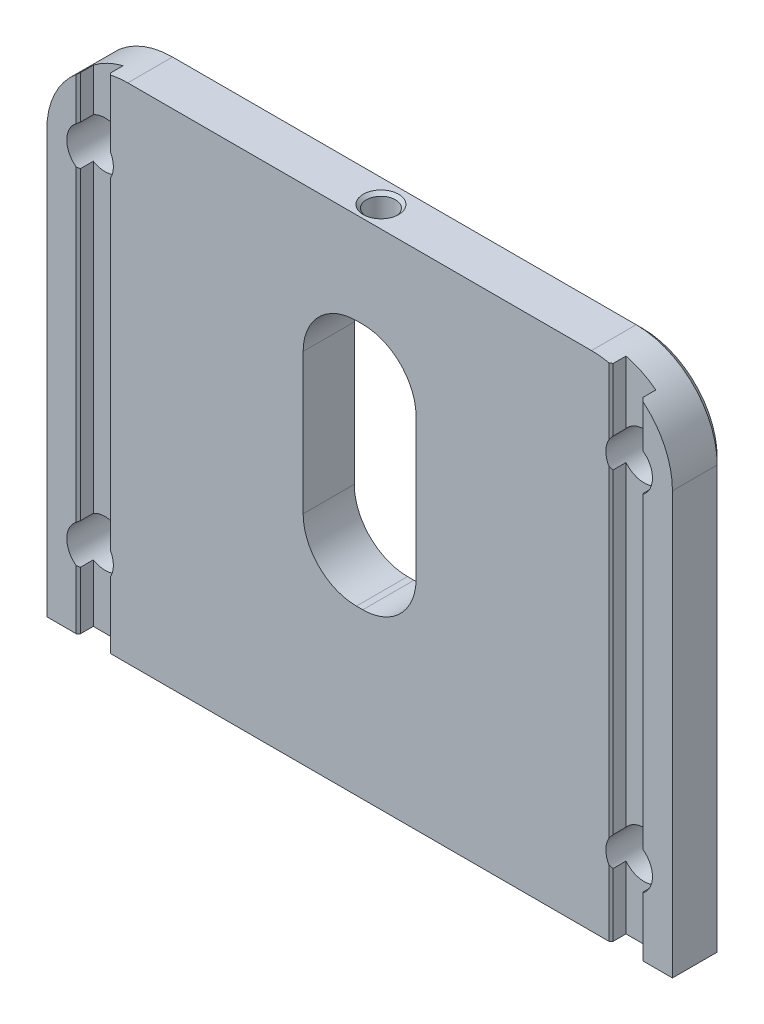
ISO-10303-21;
HEADER;
FILE_DESCRIPTION(('STEP AP214'),'2;1');
FILE_NAME('part.step','',(''),(''),'','','');
FILE_SCHEMA(('AUTOMOTIVE_DESIGN { 1 0 10303 214 1 1 1 1 }'));
ENDSEC;
DATA;
#1=APPLICATION_CONTEXT('core data for automotive mechanical design processes');
#2=APPLICATION_PROTOCOL_DEFINITION('international standard','automotive_design',2000,#1);
#3=PRODUCT_CONTEXT('',#1,'mechanical');
#4=PRODUCT('Part','Part','',(#3));
#5=PRODUCT_RELATED_PRODUCT_CATEGORY('part','',(#4));
#6=PRODUCT_DEFINITION_FORMATION('','',#4);
#7=PRODUCT_DEFINITION_CONTEXT('part definition',#1,'design');
#8=PRODUCT_DEFINITION('design','',#6,#7);
#9=PRODUCT_DEFINITION_SHAPE('','',#8);
#10=(LENGTH_UNIT() NAMED_UNIT(*) SI_UNIT(.MILLI.,.METRE.));
#11=(NAMED_UNIT(*) PLANE_ANGLE_UNIT() SI_UNIT($,.RADIAN.));
#12=(NAMED_UNIT(*) SI_UNIT($,.STERADIAN.) SOLID_ANGLE_UNIT());
#13=UNCERTAINTY_MEASURE_WITH_UNIT(LENGTH_MEASURE(1.E-05),#10,'distance_accuracy_value','');
#14=(GEOMETRIC_REPRESENTATION_CONTEXT(3) GLOBAL_UNCERTAINTY_ASSIGNED_CONTEXT((#13)) GLOBAL_UNIT_ASSIGNED_CONTEXT((#10,
#11,#12)) REPRESENTATION_CONTEXT('',''));
#15=CARTESIAN_POINT('',(0.,0.,0.));
#16=DIRECTION('',(0.,0.,1.));
#17=DIRECTION('',(1.,0.,0.));
#18=AXIS2_PLACEMENT_3D('',#15,#16,#17);
#19=CARTESIAN_POINT('',(-6.731,49.276,-167.54486360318));
#20=DIRECTION('',(0.,-1.,0.));
#21=DIRECTION('',(0.,0.,-1.));
#22=AXIS2_PLACEMENT_3D('',#19,#20,#21);
#23=PLANE('',#22);
#24=DIRECTION('',(0.,0.,1.));
#25=VECTOR('',#24,1.);
#26=CARTESIAN_POINT('',(0.381,49.276,-16.256));
#27=LINE('',#26,#25);
#28=CARTESIAN_POINT('',(0.381,49.276,-17.1113460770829));
#29=VERTEX_POINT('',#28);
#30=CARTESIAN_POINT('',(0.381,49.276,-16.7483440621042));
#31=VERTEX_POINT('',#30);
#32=EDGE_CURVE('E942',#29,#31,#27,.T.);
#33=ORIENTED_EDGE('',*,*,#32,.T.);
#34=CARTESIAN_POINT('',(0.,49.276,-18.796));
#35=DIRECTION('',(0.,-1.,0.));
#36=DIRECTION('',(0.,0.,-1.));
#37=AXIS2_PLACEMENT_3D('',#34,#35,#36);
#38=CIRCLE('',#37,2.0828);
#39=CARTESIAN_POINT('',(-0.381,49.276,-16.7483440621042));
#40=VERTEX_POINT('',#39);
#41=EDGE_CURVE('E861',#31,#40,#38,.T.);
#42=ORIENTED_EDGE('',*,*,#41,.T.);
#43=DIRECTION('',(0.,0.,1.));
#44=VECTOR('',#43,1.);
#45=CARTESIAN_POINT('',(-0.381,49.276,-22.352));
#46=LINE('',#45,#44);
#47=CARTESIAN_POINT('',(-0.381,49.276,-17.1113460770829));
#48=VERTEX_POINT('',#47);
#49=EDGE_CURVE('E938',#40,#48,#46,.F.);
#50=ORIENTED_EDGE('',*,*,#49,.T.);
#51=CARTESIAN_POINT('',(0.,49.276,-18.796));
#52=DIRECTION('',(0.,-1.,0.));
#53=DIRECTION('',(0.,0.,-1.));
#54=AXIS2_PLACEMENT_3D('',#51,#52,#53);
#55=CIRCLE('',#54,1.7272);
#56=EDGE_CURVE('E774',#48,#29,#55,.F.);
#57=ORIENTED_EDGE('',*,*,#56,.T.);
#58=EDGE_LOOP('',(#33,#42,#50,#57));
#59=FACE_BOUND('',#58,.T.);
#60=ADVANCED_FACE('F15',(#59),#23,.T.);
#61=CARTESIAN_POINT('',(-0.381,49.276,-20.4806539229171));
#62=VERTEX_POINT('',#61);
#63=CARTESIAN_POINT('',(-0.381,49.276,-20.8436559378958));
#64=VERTEX_POINT('',#63);
#65=EDGE_CURVE('E939',#62,#64,#46,.F.);
#66=ORIENTED_EDGE('',*,*,#65,.T.);
#67=CARTESIAN_POINT('',(0.,49.276,-18.796));
#68=DIRECTION('',(0.,-1.,0.));
#69=DIRECTION('',(0.,0.,-1.));
#70=AXIS2_PLACEMENT_3D('',#67,#68,#69);
#71=CIRCLE('',#70,2.0828);
#72=CARTESIAN_POINT('',(0.381,49.276,-20.8436559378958));
#73=VERTEX_POINT('',#72);
#74=EDGE_CURVE('E967',#64,#73,#71,.T.);
#75=ORIENTED_EDGE('',*,*,#74,.T.);
#76=CARTESIAN_POINT('',(0.381,49.276,-20.4806539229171));
#77=VERTEX_POINT('',#76);
#78=EDGE_CURVE('E941',#73,#77,#27,.T.);
#79=ORIENTED_EDGE('',*,*,#78,.T.);
#80=CARTESIAN_POINT('',(0.,49.276,-18.796));
#81=DIRECTION('',(0.,-1.,0.));
#82=DIRECTION('',(0.,0.,-1.));
#83=AXIS2_PLACEMENT_3D('',#80,#81,#82);
#84=CIRCLE('',#83,1.7272);
#85=EDGE_CURVE('E771',#77,#62,#84,.F.);
#86=ORIENTED_EDGE('',*,*,#85,.T.);
#87=EDGE_LOOP('',(#66,#75,#79,#86));
#88=FACE_BOUND('',#87,.T.);
#89=ADVANCED_FACE('F840',(#88),#23,.T.);
#90=CARTESIAN_POINT('',(0.381,42.926,-167.54486360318));
#91=DIRECTION('',(0.,0.,-1.));
#92=DIRECTION('',(-1.,0.,0.));
#93=AXIS2_PLACEMENT_3D('',#90,#91,#92);
#94=CYLINDRICAL_SURFACE('',#93,6.35);
#95=CARTESIAN_POINT('',(0.381,49.276,-16.7483440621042));
#96=CARTESIAN_POINT('',(0.437529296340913,49.2760039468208,-16.7588611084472));
#97=CARTESIAN_POINT('',(0.493592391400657,49.2752443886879,-16.7717171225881));
#98=CARTESIAN_POINT('',(0.604417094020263,49.2723098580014,-16.8019998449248));
#99=CARTESIAN_POINT('',(0.659179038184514,49.270135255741,-16.8194253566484));
#100=CARTESIAN_POINT('',(0.820665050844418,49.2616733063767,-16.878281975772));
#101=CARTESIAN_POINT('',(0.9249487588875,49.2534464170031,-16.9263606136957));
#102=CARTESIAN_POINT('',(1.12383473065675,49.2331959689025,-17.0386972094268));
#103=CARTESIAN_POINT('',(1.21844127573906,49.2211740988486,-17.1029479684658));
#104=CARTESIAN_POINT('',(1.39576017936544,49.1950349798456,-17.24587856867));
#105=CARTESIAN_POINT('',(1.47846856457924,49.1809170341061,-17.3245632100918));
#106=CARTESIAN_POINT('',(1.63195248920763,49.152065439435,-17.4966041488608));
#107=CARTESIAN_POINT('',(1.70235174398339,49.1373254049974,-17.5902952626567));
#108=CARTESIAN_POINT('',(1.82659794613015,49.1095924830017,-17.7883955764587));
#109=CARTESIAN_POINT('',(1.88043621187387,49.0966005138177,-17.8928103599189));
#110=CARTESIAN_POINT('',(1.97016756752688,49.0741058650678,-18.1101413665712));
#111=CARTESIAN_POINT('',(2.00595761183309,49.0646233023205,-18.2231022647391));
#112=CARTESIAN_POINT('',(2.0578318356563,49.0506628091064,-18.4535623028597));
#113=CARTESIAN_POINT('',(2.07396465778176,49.0461725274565,-18.5710494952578));
#114=CARTESIAN_POINT('',(2.08185563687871,49.0439705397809,-18.724004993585));
#115=CARTESIAN_POINT('',(2.08277553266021,49.0437128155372,-18.7591018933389));
#116=CARTESIAN_POINT('',(2.0827992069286,49.0437103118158,-18.7941824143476));
#117=B_SPLINE_CURVE_WITH_KNOTS('',3,(#95,#96,#97,#98,#99,#100,#101,#102,#103,#104,#105,#106,
#107,#108,#109,#110,#111,#112,#113,#114,#115,#116),.UNSPECIFIED.,.F.,.F.,(4,2,2,2,2,2,2,2,2,2,
4),(0.,0.172384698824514,0.344724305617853,0.68832082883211,1.03176467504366,1.37532294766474,
1.72802722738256,2.08091608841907,2.43579756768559,2.78979908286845,2.89507613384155),.UNSPECIFIED.);
#118=CARTESIAN_POINT('',(2.0827992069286,49.0437103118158,-18.7941824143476));
#119=VERTEX_POINT('',#118);
#120=EDGE_CURVE('E860',#31,#119,#117,.T.);
#121=ORIENTED_EDGE('',*,*,#120,.F.);
#122=ORIENTED_EDGE('',*,*,#32,.F.);
#123=CARTESIAN_POINT('',(0.,49.2645596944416,-17.0688));
#124=CARTESIAN_POINT('',(0.0943401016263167,49.2702294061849,-17.0688015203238));
#125=CARTESIAN_POINT('',(0.188824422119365,49.2737757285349,-17.0765540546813));
#126=CARTESIAN_POINT('',(0.375331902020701,49.2766831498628,-17.1074249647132));
#127=CARTESIAN_POINT('',(0.46735435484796,49.2760430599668,-17.1305477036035));
#128=CARTESIAN_POINT('',(0.646208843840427,49.2710899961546,-17.1914589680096));
#129=CARTESIAN_POINT('',(0.733045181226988,49.2667801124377,-17.2292351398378));
#130=CARTESIAN_POINT('',(0.899249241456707,49.2553654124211,-17.3183446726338));
#131=CARTESIAN_POINT('',(0.978616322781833,49.2482603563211,-17.3696791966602));
#132=CARTESIAN_POINT('',(1.12893061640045,49.2322591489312,-17.4853284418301));
#133=CARTESIAN_POINT('',(1.1997365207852,49.2233381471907,-17.5498232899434));
#134=CARTESIAN_POINT('',(1.32972221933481,49.2050718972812,-17.6895786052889));
#135=CARTESIAN_POINT('',(1.3889005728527,49.195726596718,-17.7648404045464));
#136=CARTESIAN_POINT('',(1.49518250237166,49.1777255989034,-17.9258579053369));
#137=CARTESIAN_POINT('',(1.54200550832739,49.1690885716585,-18.0118012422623));
#138=CARTESIAN_POINT('',(1.62053467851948,49.153974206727,-18.1905157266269));
#139=CARTESIAN_POINT('',(1.65224212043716,49.1474966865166,-18.2832862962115));
#140=CARTESIAN_POINT('',(1.69932164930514,49.1376911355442,-18.4721131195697));
#141=CARTESIAN_POINT('',(1.71484581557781,49.1343338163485,-18.5681298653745));
#142=CARTESIAN_POINT('',(1.72957284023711,49.1311520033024,-18.7614592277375));
#143=CARTESIAN_POINT('',(1.72877777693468,49.1313270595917,-18.8587716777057));
#144=CARTESIAN_POINT('',(1.71106974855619,49.135145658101,-19.0499800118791));
#145=CARTESIAN_POINT('',(1.69446192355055,49.1387235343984,-19.1439057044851));
#146=CARTESIAN_POINT('',(1.64609690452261,49.1487513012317,-19.327608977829));
#147=CARTESIAN_POINT('',(1.61433871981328,49.1552013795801,-19.4173862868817));
#148=CARTESIAN_POINT('',(1.5363303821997,49.170140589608,-19.5910049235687));
#149=CARTESIAN_POINT('',(1.48997670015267,49.1786441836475,-19.6747984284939));
#150=CARTESIAN_POINT('',(1.38413591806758,49.1964936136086,-19.8335407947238));
#151=CARTESIAN_POINT('',(1.32464698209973,49.2058395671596,-19.9084884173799));
#152=CARTESIAN_POINT('',(1.19277214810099,49.2242566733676,-20.0489891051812));
#153=CARTESIAN_POINT('',(1.12015055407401,49.2333184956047,-20.1143224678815));
#154=CARTESIAN_POINT('',(0.964808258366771,49.2495872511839,-20.2319153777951));
#155=CARTESIAN_POINT('',(0.882087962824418,49.2567942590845,-20.2841754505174));
#156=CARTESIAN_POINT('',(0.709298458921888,49.2680948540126,-20.3738266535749));
#157=CARTESIAN_POINT('',(0.619270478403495,49.2722047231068,-20.4112950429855));
#158=CARTESIAN_POINT('',(0.434116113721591,49.2764520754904,-20.4705766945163));
#159=CARTESIAN_POINT('',(0.338990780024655,49.2765903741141,-20.492393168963));
#160=CARTESIAN_POINT('',(0.149080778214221,49.2724553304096,-20.5193541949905));
#161=CARTESIAN_POINT('',(0.0543538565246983,49.268298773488,-20.5249251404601));
#162=CARTESIAN_POINT('',(-0.134450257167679,49.2557521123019,-20.5205461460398));
#163=CARTESIAN_POINT('',(-0.228527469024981,49.2473621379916,-20.5105966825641));
#164=CARTESIAN_POINT('',(-0.412962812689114,49.2268490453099,-20.47571764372));
#165=CARTESIAN_POINT('',(-0.503336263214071,49.2147435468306,-20.4508582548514));
#166=CARTESIAN_POINT('',(-0.678508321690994,49.1876137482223,-20.3870811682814));
#167=CARTESIAN_POINT('',(-0.763305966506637,49.1725889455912,-20.348161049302));
#168=CARTESIAN_POINT('',(-0.92789790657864,49.1402215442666,-20.2559341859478));
#169=CARTESIAN_POINT('',(-1.0074442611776,49.1228200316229,-20.2022057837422));
#170=CARTESIAN_POINT('',(-1.15651812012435,49.0875271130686,-20.0824037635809));
#171=CARTESIAN_POINT('',(-1.22604309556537,49.0696355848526,-20.016327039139));
#172=CARTESIAN_POINT('',(-1.35529775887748,49.0343877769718,-19.8712267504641));
#173=CARTESIAN_POINT('',(-1.41466146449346,49.0170647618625,-19.7918681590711));
#174=CARTESIAN_POINT('',(-1.51915807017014,48.9852816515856,-19.6237497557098));
#175=CARTESIAN_POINT('',(-1.56429280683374,48.9708211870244,-19.5349911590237));
#176=CARTESIAN_POINT('',(-1.63808580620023,48.946571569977,-19.3522517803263));
#177=CARTESIAN_POINT('',(-1.66704170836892,48.9366986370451,-19.2584027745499));
#178=CARTESIAN_POINT('',(-1.708656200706,48.9223599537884,-19.0667704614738));
#179=CARTESIAN_POINT('',(-1.72132153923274,48.917891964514,-18.9689888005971));
#180=CARTESIAN_POINT('',(-1.72961805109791,48.9149736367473,-18.7776732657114));
#181=CARTESIAN_POINT('',(-1.72609166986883,48.9162256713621,-18.684179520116));
#182=CARTESIAN_POINT('',(-1.70405570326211,48.9239310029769,-18.4992028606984));
#183=CARTESIAN_POINT('',(-1.68554667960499,48.9303841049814,-18.407719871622));
#184=CARTESIAN_POINT('',(-1.63453467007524,48.9476963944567,-18.2303722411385));
#185=CARTESIAN_POINT('',(-1.60219719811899,48.9585033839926,-18.1444545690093));
#186=CARTESIAN_POINT('',(-1.52459719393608,48.9834626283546,-17.9792007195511));
#187=CARTESIAN_POINT('',(-1.47933204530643,48.9976155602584,-17.8998658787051));
#188=CARTESIAN_POINT('',(-1.37487577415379,49.0286624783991,-17.7462685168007));
#189=CARTESIAN_POINT('',(-1.31516098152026,49.0456494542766,-17.6723810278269));
#190=CARTESIAN_POINT('',(-1.18454678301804,49.0803581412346,-17.5354334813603));
#191=CARTESIAN_POINT('',(-1.11364362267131,49.0980800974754,-17.472377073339));
#192=CARTESIAN_POINT('',(-0.959292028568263,49.1334654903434,-17.356322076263));
#193=CARTESIAN_POINT('',(-0.875452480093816,49.1510976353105,-17.3038327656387));
#194=CARTESIAN_POINT('',(-0.699699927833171,49.1839996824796,-17.2137934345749));
#195=CARTESIAN_POINT('',(-0.607790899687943,49.1992707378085,-17.1762361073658));
#196=CARTESIAN_POINT('',(-0.430524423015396,49.2244837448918,-17.1210804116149));
#197=CARTESIAN_POINT('',(-0.34582612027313,49.2348569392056,-17.1015475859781));
#198=CARTESIAN_POINT('',(-0.174125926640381,49.2522765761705,-17.0754078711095));
#199=CARTESIAN_POINT('',(-0.0871244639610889,49.259323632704,-17.0687985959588));
#200=CARTESIAN_POINT('',(0.,49.2645596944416,-17.0688));
#201=B_SPLINE_CURVE_WITH_KNOTS('',3,(#123,#124,#125,#126,#127,#128,#129,#130,#131,#132,#133,
#134,#135,#136,#137,#138,#139,#140,#141,#142,#143,#144,#145,#146,#147,#148,#149,#150,#151,#152,
#153,#154,#155,#156,#157,#158,#159,#160,#161,#162,#163,#164,#165,#166,#167,#168,#169,#170,#171,
#172,#173,#174,#175,#176,#177,#178,#179,#180,#181,#182,#183,#184,#185,#186,#187,#188,#189,#190,
#191,#192,#193,#194,#195,#196,#197,#198,#199,#200),.UNSPECIFIED.,.T.,.F.,(4,2,2,2,2,2,2,2,2,2,2,
2,2,2,2,2,2,2,2,2,2,2,2,2,2,2,2,2,2,2,2,2,2,2,2,2,2,2,4),(0.,0.283217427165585,
0.566515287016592,0.849574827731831,1.13265865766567,1.41991396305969,1.70720483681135,
2.00054661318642,2.29386358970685,2.58439862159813,2.87489665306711,3.15990017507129,
3.44492233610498,3.73201358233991,4.0191449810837,4.31206142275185,4.60496608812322,
4.89631996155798,5.18761402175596,5.47119050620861,5.75475828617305,6.03700157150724,
6.31929348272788,6.61064579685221,6.90207150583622,7.20243860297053,7.50276691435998,
7.79737107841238,8.09185316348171,8.37119230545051,8.65052097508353,8.92659600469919,
9.20272694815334,9.49096770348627,9.77930539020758,10.0792923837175,10.3791324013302,
10.6407361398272,10.9022915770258),.UNSPECIFIED.);
#202=EDGE_CURVE('E690',#77,#29,#201,.F.);
#203=ORIENTED_EDGE('',*,*,#202,.F.);
#204=ORIENTED_EDGE('',*,*,#78,.F.);
#205=CARTESIAN_POINT('',(2.0828,49.0437100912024,-18.796));
#206=CARTESIAN_POINT('',(2.08280089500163,49.0437049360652,-18.853549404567));
#207=CARTESIAN_POINT('',(2.08041328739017,49.0443745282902,-18.9110700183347));
#208=CARTESIAN_POINT('',(2.07089655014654,49.047011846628,-19.0256762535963));
#209=CARTESIAN_POINT('',(2.06376837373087,49.0489793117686,-19.0827619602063));
#210=CARTESIAN_POINT('',(2.03538265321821,49.0567361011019,-19.2524893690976));
#211=CARTESIAN_POINT('',(2.00712340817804,49.0643804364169,-19.363957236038));
#212=CARTESIAN_POINT('',(1.93286325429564,49.0835701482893,-19.5803476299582));
#213=CARTESIAN_POINT('',(1.88686591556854,49.0951147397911,-19.6852714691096));
#214=CARTESIAN_POINT('',(1.77847473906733,49.1205664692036,-19.8859963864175));
#215=CARTESIAN_POINT('',(1.7160764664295,49.1344742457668,-19.981794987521));
#216=CARTESIAN_POINT('',(1.57490770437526,49.1631772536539,-20.163957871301));
#217=CARTESIAN_POINT('',(1.4957912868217,49.1779855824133,-20.2500520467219));
#218=CARTESIAN_POINT('',(1.32408689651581,49.2061785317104,-20.4079731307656));
#219=CARTESIAN_POINT('',(1.23149081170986,49.2195622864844,-20.4797913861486));
#220=CARTESIAN_POINT('',(1.03435029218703,49.2430865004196,-20.6076612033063));
#221=CARTESIAN_POINT('',(0.929701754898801,49.2531953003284,-20.6635582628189));
#222=CARTESIAN_POINT('',(0.712296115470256,49.2682799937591,-20.7567659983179));
#223=CARTESIAN_POINT('',(0.599560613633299,49.2732690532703,-20.7941242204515));
#224=CARTESIAN_POINT('',(0.450233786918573,49.2757185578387,-20.8298659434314));
#225=CARTESIAN_POINT('',(0.415691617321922,49.2760051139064,-20.8372082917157));
#226=CARTESIAN_POINT('',(0.381,49.276,-20.8436559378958));
#227=B_SPLINE_CURVE_WITH_KNOTS('',3,(#205,#206,#207,#208,#209,#210,#211,#212,#213,#214,#215,
#216,#217,#218,#219,#220,#221,#222,#223,#224,#225,#226),.UNSPECIFIED.,.F.,.F.,(4,2,2,2,2,2,2,2,
2,2,4),(0.,0.172538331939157,0.345041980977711,0.688995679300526,1.03288018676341,
1.37685777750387,1.72880742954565,2.08096976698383,2.43644139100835,2.79099657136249,
2.89688792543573),.UNSPECIFIED.);
#228=CARTESIAN_POINT('',(2.0828,49.0437100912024,-18.796));
#229=VERTEX_POINT('',#228);
#230=EDGE_CURVE('E854',#229,#73,#227,.T.);
#231=ORIENTED_EDGE('',*,*,#230,.F.);
#232=CARTESIAN_POINT('',(0.381,42.926,-18.796));
#233=DIRECTION('',(0.,0.,1.));
#234=DIRECTION('',(1.,0.,0.));
#235=AXIS2_PLACEMENT_3D('',#232,#233,#234);
#236=CIRCLE('',#235,6.35);
#237=CARTESIAN_POINT('',(2.083054,49.0436394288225,-18.796));
#238=VERTEX_POINT('',#237);
#239=EDGE_CURVE('E869',#238,#229,#236,.T.);
#240=ORIENTED_EDGE('',*,*,#239,.F.);
#241=CARTESIAN_POINT('',(2.083054,49.0436394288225,-18.796));
#242=CARTESIAN_POINT('',(2.08305489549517,49.0436342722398,-18.8535560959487));
#243=CARTESIAN_POINT('',(2.08066702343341,49.0443040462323,-18.9110833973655));
#244=CARTESIAN_POINT('',(2.07114923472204,49.0469420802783,-19.0257029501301));
#245=CARTESIAN_POINT('',(2.06402027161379,49.0489100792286,-19.0827952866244));
#246=CARTESIAN_POINT('',(2.03563143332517,49.0566689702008,-19.2525423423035));
#247=CARTESIAN_POINT('',(2.00736909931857,49.0643153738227,-19.3640230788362));
#248=CARTESIAN_POINT('',(1.93310089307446,49.0835102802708,-19.5804384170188));
#249=CARTESIAN_POINT('',(1.88709859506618,49.0950579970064,-19.685374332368));
#250=CARTESIAN_POINT('',(1.77869578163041,49.1205166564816,-19.8861224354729));
#251=CARTESIAN_POINT('',(1.71629082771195,49.1344282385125,-19.98193214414));
#252=CARTESIAN_POINT('',(1.57510646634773,49.1631393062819,-20.1641169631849));
#253=CARTESIAN_POINT('',(1.49598098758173,49.1779518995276,-20.2502218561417));
#254=CARTESIAN_POINT('',(1.32425679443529,49.2061531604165,-20.4081627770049));
#255=CARTESIAN_POINT('',(1.23164996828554,49.2195409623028,-20.4799901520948));
#256=CARTESIAN_POINT('',(1.03448596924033,49.2430726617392,-20.6078767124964));
#257=CARTESIAN_POINT('',(0.929824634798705,49.2531848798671,-20.6637813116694));
#258=CARTESIAN_POINT('',(0.712392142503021,49.2682752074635,-20.7570018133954));
#259=CARTESIAN_POINT('',(0.599642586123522,49.2732664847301,-20.7943652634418));
#260=CARTESIAN_POINT('',(0.450279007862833,49.2757181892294,-20.8301164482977));
#261=CARTESIAN_POINT('',(0.415714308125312,49.2760051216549,-20.8374632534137));
#262=CARTESIAN_POINT('',(0.381,49.276,-20.8439142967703));
#263=B_SPLINE_CURVE_WITH_KNOTS('',3,(#241,#242,#243,#244,#245,#246,#247,#248,#249,#250,#251,
#252,#253,#254,#255,#256,#257,#258,#259,#260,#261,#262),.UNSPECIFIED.,.F.,.F.,(4,2,2,2,2,2,2,2,
2,2,4),(0.,0.172558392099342,0.345082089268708,0.689075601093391,1.03299984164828,
1.37701724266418,1.72901005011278,2.08121553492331,2.43673213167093,2.79133225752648,
2.897292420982),.UNSPECIFIED.);
#264=CARTESIAN_POINT('',(0.381,49.276,-20.8439142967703));
#265=VERTEX_POINT('',#264);
#266=EDGE_CURVE('E825',#238,#265,#263,.T.);
#267=ORIENTED_EDGE('',*,*,#266,.T.);
#268=CARTESIAN_POINT('',(0.381,49.276,-22.352));
#269=VERTEX_POINT('',#268);
#270=EDGE_CURVE('E745',#269,#265,#27,.T.);
#271=ORIENTED_EDGE('',*,*,#270,.F.);
#272=CARTESIAN_POINT('',(0.381,42.926,-22.352));
#273=DIRECTION('',(0.,0.,-1.));
#274=DIRECTION('',(-1.,0.,0.));
#275=AXIS2_PLACEMENT_3D('',#272,#273,#274);
#276=CIRCLE('',#275,6.35);
#277=CARTESIAN_POINT('',(6.731,42.926,-22.352));
#278=VERTEX_POINT('',#277);
#279=EDGE_CURVE('E738',#278,#269,#276,.F.);
#280=ORIENTED_EDGE('',*,*,#279,.F.);
#281=DIRECTION('',(0.,0.,1.));
#282=VECTOR('',#281,1.);
#283=CARTESIAN_POINT('',(6.731,42.926,-22.352));
#284=LINE('',#283,#282);
#285=CARTESIAN_POINT('',(6.731,42.926,-16.256));
#286=VERTEX_POINT('',#285);
#287=EDGE_CURVE('E929',#286,#278,#284,.F.);
#288=ORIENTED_EDGE('',*,*,#287,.F.);
#289=CARTESIAN_POINT('',(0.381,42.926,-16.256));
#290=DIRECTION('',(0.,0.,1.));
#291=DIRECTION('',(1.,0.,0.));
#292=AXIS2_PLACEMENT_3D('',#289,#290,#291);
#293=CIRCLE('',#292,6.35);
#294=CARTESIAN_POINT('',(0.381,49.276,-16.256));
#295=VERTEX_POINT('',#294);
#296=EDGE_CURVE('E755',#295,#286,#293,.F.);
#297=ORIENTED_EDGE('',*,*,#296,.F.);
#298=CARTESIAN_POINT('',(0.381,49.276,-16.7480857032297));
#299=VERTEX_POINT('',#298);
#300=EDGE_CURVE('E937',#299,#295,#27,.T.);
#301=ORIENTED_EDGE('',*,*,#300,.F.);
#302=CARTESIAN_POINT('',(0.381,49.276,-16.7480857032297));
#303=CARTESIAN_POINT('',(0.437536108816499,49.2760039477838,-16.758602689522));
#304=CARTESIAN_POINT('',(0.49360601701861,49.2752442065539,-16.7714589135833));
#305=CARTESIAN_POINT('',(0.604444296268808,49.2723089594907,-16.8017425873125));
#306=CARTESIAN_POINT('',(0.65921300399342,49.2701338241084,-16.8191688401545));
#307=CARTESIAN_POINT('',(0.820719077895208,49.2616697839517,-16.8780284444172));
#308=CARTESIAN_POINT('',(0.925015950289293,49.2534408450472,-16.9261100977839));
#309=CARTESIAN_POINT('',(1.12392749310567,49.2331852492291,-17.038454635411));
#310=CARTESIAN_POINT('',(1.21854644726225,49.2211602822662,-17.102710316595));
#311=CARTESIAN_POINT('',(1.39588923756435,49.1950142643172,-17.2456525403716));
#312=CARTESIAN_POINT('',(1.47860909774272,49.1808925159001,-17.3243438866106));
#313=CARTESIAN_POINT('',(1.63211565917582,49.1520328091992,-17.4964006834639));
#314=CARTESIAN_POINT('',(1.70252594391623,49.1372884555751,-17.5901010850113));
#315=CARTESIAN_POINT('',(1.8267925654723,49.10954709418,-17.7882217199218));
#316=CARTESIAN_POINT('',(1.88064022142,49.0965510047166,-17.8926475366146));
#317=CARTESIAN_POINT('',(1.97038869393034,49.0740487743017,-18.1100026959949));
#318=CARTESIAN_POINT('',(2.00618637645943,49.0645627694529,-18.2229767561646));
#319=CARTESIAN_POINT('',(2.05807347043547,49.0505966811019,-18.4534643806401));
#320=CARTESIAN_POINT('',(2.07421152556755,49.0461042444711,-18.5709659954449));
#321=CARTESIAN_POINT('',(2.08210855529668,49.0439002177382,-18.7239590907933));
#322=CARTESIAN_POINT('',(2.08302952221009,49.0436421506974,-18.7590788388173));
#323=CARTESIAN_POINT('',(2.08305320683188,49.0436396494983,-18.7941821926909));
#324=B_SPLINE_CURVE_WITH_KNOTS('',3,(#302,#303,#304,#305,#306,#307,#308,#309,#310,#311,#312,
#313,#314,#315,#316,#317,#318,#319,#320,#321,#322,#323),.UNSPECIFIED.,.F.,.F.,(4,2,2,2,2,2,2,2,
2,2,4),(0.,0.172404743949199,0.344764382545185,0.688400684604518,1.03188421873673,
1.3754822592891,1.72822979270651,2.08116189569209,2.43608835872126,2.79013483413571,
2.89548040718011),.UNSPECIFIED.);
#325=CARTESIAN_POINT('',(2.08305320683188,49.0436396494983,-18.7941821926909));
#326=VERTEX_POINT('',#325);
#327=EDGE_CURVE('E831',#299,#326,#324,.T.);
#328=ORIENTED_EDGE('',*,*,#327,.T.);
#329=CARTESIAN_POINT('',(0.381,42.926,-18.7956675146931));
#330=DIRECTION('',(-0.000872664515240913,0.,0.99999961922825));
#331=DIRECTION('',(-0.99999961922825,0.,-0.000872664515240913));
#332=AXIS2_PLACEMENT_3D('',#329,#330,#331);
#333=ELLIPSE('',#332,6.35000241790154,6.35);
#334=EDGE_CURVE('E424',#119,#326,#333,.F.);
#335=ORIENTED_EDGE('',*,*,#334,.F.);
#336=EDGE_LOOP('',(#121,#122,#203,#204,#231,#240,#267,#271,#280,#288,#297,#301,#328,#335));
#337=FACE_BOUND('',#336,.T.);
#338=ADVANCED_FACE('F836',(#337),#94,.F.);
#339=CARTESIAN_POINT('',(-0.381,42.926,-167.54486360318));
#340=DIRECTION('',(0.,0.,-1.));
#341=DIRECTION('',(-1.,0.,0.));
#342=AXIS2_PLACEMENT_3D('',#339,#340,#341);
#343=CYLINDRICAL_SURFACE('',#342,6.35);
#344=CARTESIAN_POINT('',(-0.381,49.276,-20.8436559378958));
#345=CARTESIAN_POINT('',(-0.43753081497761,49.2760039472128,-20.8331386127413));
#346=CARTESIAN_POINT('',(-0.493595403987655,49.275244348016,-20.8202821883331));
#347=CARTESIAN_POINT('',(-0.604423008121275,49.2723096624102,-20.789998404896));
#348=CARTESIAN_POINT('',(-0.659186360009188,49.2701349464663,-20.7725722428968));
#349=CARTESIAN_POINT('',(-0.82067066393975,49.2616728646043,-20.7137154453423));
#350=CARTESIAN_POINT('',(-0.924951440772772,49.2534461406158,-20.6656379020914));
#351=CARTESIAN_POINT('',(-1.12382909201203,49.2331965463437,-20.5533059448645));
#352=CARTESIAN_POINT('',(-1.21843053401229,49.2211754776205,-20.4890592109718));
#353=CARTESIAN_POINT('',(-1.39575079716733,49.1950365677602,-20.3461304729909));
#354=CARTESIAN_POINT('',(-1.47846429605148,49.1809177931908,-20.2674420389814));
#355=CARTESIAN_POINT('',(-1.63197155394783,49.1520619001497,-20.0953740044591));
#356=CARTESIAN_POINT('',(-1.70238620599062,49.1373183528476,-20.0016570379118));
#357=CARTESIAN_POINT('',(-1.82662465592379,49.1095858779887,-19.8035545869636));
#358=CARTESIAN_POINT('',(-1.88044791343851,49.0965970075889,-19.6991687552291));
#359=CARTESIAN_POINT('',(-1.97011774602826,49.0741189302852,-19.4819718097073));
#360=CARTESIAN_POINT('',(-2.00587687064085,49.0646468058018,-19.3691226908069));
#361=CARTESIAN_POINT('',(-2.05779871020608,49.0506699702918,-19.1387179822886));
#362=CARTESIAN_POINT('',(-2.07396725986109,49.0461637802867,-19.0211638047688));
#363=CARTESIAN_POINT('',(-2.0859269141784,49.0428422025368,-18.7888239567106));
#364=CARTESIAN_POINT('',(-2.0823693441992,49.043844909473,-18.6740740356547));
#365=CARTESIAN_POINT('',(-2.05651142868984,49.0509765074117,-18.4468746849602));
#366=CARTESIAN_POINT('',(-2.03421116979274,49.0571053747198,-18.3344252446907));
#367=CARTESIAN_POINT('',(-1.97192673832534,49.0735578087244,-18.1160479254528));
#368=CARTESIAN_POINT('',(-1.93211301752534,49.0838408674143,-18.0100681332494));
#369=CARTESIAN_POINT('',(-1.8360381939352,49.1072456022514,-17.8061898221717));
#370=CARTESIAN_POINT('',(-1.77977475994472,49.1203676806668,-17.7082924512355));
#371=CARTESIAN_POINT('',(-1.65031625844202,49.148205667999,-17.5200850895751));
#372=CARTESIAN_POINT('',(-1.57665073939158,49.1629583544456,-17.430104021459));
#373=CARTESIAN_POINT('',(-1.41528676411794,49.1917365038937,-17.2635286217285));
#374=CARTESIAN_POINT('',(-1.32758206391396,49.2057616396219,-17.1869402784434));
#375=CARTESIAN_POINT('',(-1.13879889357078,49.2313521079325,-17.0480979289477));
#376=CARTESIAN_POINT('',(-1.03751781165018,49.2428713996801,-16.9861107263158));
#377=CARTESIAN_POINT('',(-0.825647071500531,49.2612998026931,-16.8801893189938));
#378=CARTESIAN_POINT('',(-0.715075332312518,49.2682175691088,-16.8362212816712));
#379=CARTESIAN_POINT('',(-0.565365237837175,49.2734281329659,-16.7910403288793));
#380=CARTESIAN_POINT('',(-0.52879995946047,49.2743869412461,-16.7810889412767));
#381=CARTESIAN_POINT('',(-0.455224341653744,49.2756721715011,-16.7632055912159));
#382=CARTESIAN_POINT('',(-0.418214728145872,49.2759995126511,-16.7552707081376));
#383=CARTESIAN_POINT('',(-0.381000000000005,49.276,-16.7483440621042));
#384=B_SPLINE_CURVE_WITH_KNOTS('',3,(#344,#345,#346,#347,#348,#349,#350,#351,#352,#353,#354,
#355,#356,#357,#358,#359,#360,#361,#362,#363,#364,#365,#366,#367,#368,#369,#370,#371,#372,#373,
#374,#375,#376,#377,#378,#379,#380,#381,#382,#383),.UNSPECIFIED.,.F.,.F.,(4,2,2,2,2,2,2,2,2,2,2,
2,2,2,2,2,2,2,2,4),(0.,0.172389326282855,0.344733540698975,0.688320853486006,1.03174527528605,
1.37532297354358,1.7281138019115,2.08091611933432,2.4354104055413,2.78979908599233,
3.1325575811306,3.47531449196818,3.81480684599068,4.15434733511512,4.50440448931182,
4.85461776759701,5.21080504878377,5.56632045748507,5.67999802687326,5.79350999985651),.UNSPECIFIED.);
#385=EDGE_CURVE('E973',#64,#40,#384,.T.);
#386=ORIENTED_EDGE('',*,*,#385,.F.);
#387=ORIENTED_EDGE('',*,*,#65,.F.);
#388=CARTESIAN_POINT('',(0.,49.2645596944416,-17.0688));
#389=CARTESIAN_POINT('',(0.0961837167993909,49.2587764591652,-17.0688026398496));
#390=CARTESIAN_POINT('',(0.192262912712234,49.2507837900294,-17.0768619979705));
#391=CARTESIAN_POINT('',(0.381378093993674,49.2307871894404,-17.1087006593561));
#392=CARTESIAN_POINT('',(0.474412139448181,49.2187807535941,-17.1324897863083));
#393=CARTESIAN_POINT('',(0.654696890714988,49.1916310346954,-17.1948521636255));
#394=CARTESIAN_POINT('',(0.741957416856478,49.1764932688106,-17.2333995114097));
#395=CARTESIAN_POINT('',(0.908685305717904,49.1442338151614,-17.3240893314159));
#396=CARTESIAN_POINT('',(0.988152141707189,49.1271119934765,-17.376232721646));
#397=CARTESIAN_POINT('',(1.13948826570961,49.0917786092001,-17.494364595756));
#398=CARTESIAN_POINT('',(1.21108439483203,49.0735499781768,-17.5606981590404));
#399=CARTESIAN_POINT('',(1.34222883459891,49.0380869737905,-17.7046151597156));
#400=CARTESIAN_POINT('',(1.40177548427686,49.0208527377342,-17.7822001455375));
#401=CARTESIAN_POINT('',(1.50774493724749,48.9888583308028,-17.9476582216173));
#402=CARTESIAN_POINT('',(1.55400879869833,48.9741289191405,-18.0356394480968));
#403=CARTESIAN_POINT('',(1.6309088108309,48.9489870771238,-18.2187585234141));
#404=CARTESIAN_POINT('',(1.66155048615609,48.9385731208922,-18.3138938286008));
#405=CARTESIAN_POINT('',(1.70508936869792,48.9236031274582,-18.5043925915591));
#406=CARTESIAN_POINT('',(1.71867317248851,48.9188209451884,-18.5995811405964));
#407=CARTESIAN_POINT('',(1.72984948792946,48.9148942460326,-18.7909968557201));
#408=CARTESIAN_POINT('',(1.72744630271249,48.915748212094,-18.8872237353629));
#409=CARTESIAN_POINT('',(1.70718701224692,48.9228388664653,-19.0738132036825));
#410=CARTESIAN_POINT('',(1.68996776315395,48.9288536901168,-19.1642545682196));
#411=CARTESIAN_POINT('',(1.64155713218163,48.9453363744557,-19.3408835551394));
#412=CARTESIAN_POINT('',(1.61036425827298,48.9558047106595,-19.4270707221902));
#413=CARTESIAN_POINT('',(1.53433381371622,48.9803878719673,-19.5945292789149));
#414=CARTESIAN_POINT('',(1.48926082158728,48.994564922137,-19.6756843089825));
#415=CARTESIAN_POINT('',(1.38696984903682,49.0251496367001,-19.8294744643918));
#416=CARTESIAN_POINT('',(1.32974859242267,49.0415579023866,-19.9021072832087));
#417=CARTESIAN_POINT('',(1.20137305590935,49.0760590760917,-20.0407063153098));
#418=CARTESIAN_POINT('',(1.12965535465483,49.0941952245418,-20.1061407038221));
#419=CARTESIAN_POINT('',(0.976171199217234,49.1297719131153,-20.2241751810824));
#420=CARTESIAN_POINT('',(0.894403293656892,49.1472123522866,-20.276773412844));
#421=CARTESIAN_POINT('',(0.721287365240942,49.1802270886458,-20.368491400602));
#422=CARTESIAN_POINT('',(0.629792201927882,49.1957616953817,-20.4073487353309));
#423=CARTESIAN_POINT('',(0.441012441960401,49.223291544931,-20.4688949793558));
#424=CARTESIAN_POINT('',(0.343729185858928,49.2352876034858,-20.4915876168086));
#425=CARTESIAN_POINT('',(0.149334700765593,49.2545454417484,-20.5194439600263));
#426=CARTESIAN_POINT('',(0.0523118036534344,49.2619425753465,-20.5251297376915));
#427=CARTESIAN_POINT('',(-0.141543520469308,49.2722253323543,-20.520117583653));
#428=CARTESIAN_POINT('',(-0.238375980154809,49.2751118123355,-20.5094227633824));
#429=CARTESIAN_POINT('',(-0.425952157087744,49.2765129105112,-20.4724970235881));
#430=CARTESIAN_POINT('',(-0.516791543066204,49.2751592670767,-20.446754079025));
#431=CARTESIAN_POINT('',(-0.692964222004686,49.2689451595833,-20.3808865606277));
#432=CARTESIAN_POINT('',(-0.778297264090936,49.2640845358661,-20.3407613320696));
#433=CARTESIAN_POINT('',(-0.94178446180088,49.2517253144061,-20.2469353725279));
#434=CARTESIAN_POINT('',(-1.01987933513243,49.2442070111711,-20.1931341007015));
#435=CARTESIAN_POINT('',(-1.16614976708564,49.2277034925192,-20.073591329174));
#436=CARTESIAN_POINT('',(-1.23432370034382,49.218718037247,-20.0078478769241));
#437=CARTESIAN_POINT('',(-1.36067042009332,49.2003076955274,-19.8642597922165));
#438=CARTESIAN_POINT('',(-1.41853210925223,49.190877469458,-19.7861417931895));
#439=CARTESIAN_POINT('',(-1.5204031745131,49.1731548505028,-19.6212200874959));
#440=CARTESIAN_POINT('',(-1.56441231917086,49.1648624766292,-19.5344162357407));
#441=CARTESIAN_POINT('',(-1.63743543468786,49.1505697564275,-19.3541370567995));
#442=CARTESIAN_POINT('',(-1.66639164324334,49.1445782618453,-19.2606375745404));
#443=CARTESIAN_POINT('',(-1.70812496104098,49.1358068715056,-19.0699536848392));
#444=CARTESIAN_POINT('',(-1.72090465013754,49.1330264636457,-18.972769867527));
#445=CARTESIAN_POINT('',(-1.72977132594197,49.1311055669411,-18.7796002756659));
#446=CARTESIAN_POINT('',(-1.72619342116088,49.1318920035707,-18.6836304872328));
#447=CARTESIAN_POINT('',(-1.70322696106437,49.1368252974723,-18.4936946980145));
#448=CARTESIAN_POINT('',(-1.68383860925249,49.1409721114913,-18.3997286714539));
#449=CARTESIAN_POINT('',(-1.63001338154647,49.1520106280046,-18.2169433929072));
#450=CARTESIAN_POINT('',(-1.59565779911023,49.1588874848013,-18.1280992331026));
#451=CARTESIAN_POINT('',(-1.51291924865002,49.174441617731,-17.957372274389));
#452=CARTESIAN_POINT('',(-1.46453457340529,49.1831191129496,-17.8754903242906));
#453=CARTESIAN_POINT('',(-1.35396787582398,49.2012708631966,-17.7192799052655));
#454=CARTESIAN_POINT('',(-1.29153348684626,49.2107574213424,-17.6451314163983));
#455=CARTESIAN_POINT('',(-1.15509506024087,49.2290154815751,-17.5082443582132));
#456=CARTESIAN_POINT('',(-1.08108917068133,49.2377868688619,-17.4455076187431));
#457=CARTESIAN_POINT('',(-0.922810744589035,49.2533462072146,-17.3327288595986));
#458=CARTESIAN_POINT('',(-0.838456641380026,49.2601167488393,-17.2827987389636));
#459=CARTESIAN_POINT('',(-0.662390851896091,49.2703730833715,-17.1978773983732));
#460=CARTESIAN_POINT('',(-0.570684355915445,49.2738611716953,-17.1628757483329));
#461=CARTESIAN_POINT('',(-0.399270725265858,49.2764467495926,-17.1136512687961));
#462=CARTESIAN_POINT('',(-0.320303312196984,49.27621063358,-17.0968510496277));
#463=CARTESIAN_POINT('',(-0.160866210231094,49.272684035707,-17.0744245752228));
#464=CARTESIAN_POINT('',(-0.0803965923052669,49.2693936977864,-17.0687977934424));
#465=CARTESIAN_POINT('',(0.,49.2645596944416,-17.0688));
#466=B_SPLINE_CURVE_WITH_KNOTS('',3,(#388,#389,#390,#391,#392,#393,#394,#395,#396,#397,#398,
#399,#400,#401,#402,#403,#404,#405,#406,#407,#408,#409,#410,#411,#412,#413,#414,#415,#416,#417,
#418,#419,#420,#421,#422,#423,#424,#425,#426,#427,#428,#429,#430,#431,#432,#433,#434,#435,#436,
#437,#438,#439,#440,#441,#442,#443,#444,#445,#446,#447,#448,#449,#450,#451,#452,#453,#454,#455,
#456,#457,#458,#459,#460,#461,#462,#463,#464,#465),.UNSPECIFIED.,.T.,.F.,(4,2,2,2,2,2,2,2,2,2,2,
2,2,2,2,2,2,2,2,2,2,2,2,2,2,2,2,2,2,2,2,2,2,2,2,2,2,2,4),(0.,0.288771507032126,
0.577723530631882,0.866170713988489,1.15463737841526,1.45113618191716,1.74767582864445,
2.0476285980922,2.34747521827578,2.63481952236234,2.92208648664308,3.19758933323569,
3.47312160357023,3.75361176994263,4.03417767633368,4.32911038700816,4.62408573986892,
4.92442371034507,5.22469238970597,5.51564375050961,5.80653985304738,6.08848861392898,
6.37045021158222,6.65454786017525,6.9386920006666,7.2303281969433,7.52196926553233,
7.81472133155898,8.10742670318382,8.39416277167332,8.68089514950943,8.96608920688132,
9.25131798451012,9.54214985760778,9.83302832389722,10.1263678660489,10.4195021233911,
10.6608874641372,10.9022614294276),.UNSPECIFIED.);
#467=EDGE_CURVE('E708',#48,#62,#466,.F.);
#468=ORIENTED_EDGE('',*,*,#467,.F.);
#469=ORIENTED_EDGE('',*,*,#49,.F.);
#470=EDGE_LOOP('',(#386,#387,#468,#469));
#471=FACE_BOUND('',#470,.T.);
#472=ADVANCED_FACE('F795',(#471),#343,.F.);
#473=CARTESIAN_POINT('',(0.,60.198,-18.796));
#474=DIRECTION('',(0.,1.,0.));
#475=DIRECTION('',(0.,0.,1.));
#476=AXIS2_PLACEMENT_3D('',#473,#474,#475);
#477=CONICAL_SURFACE('',#476,2.1082,0.78539816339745);
#478=CARTESIAN_POINT('',(0.,60.198,-18.796));
#479=DIRECTION('',(0.,-1.,0.));
#480=DIRECTION('',(1.,0.,0.));
#481=AXIS2_PLACEMENT_3D('',#478,#479,#480);
#482=CIRCLE('',#481,2.1082);
#483=CARTESIAN_POINT('',(2.1082,60.198,-18.796));
#484=VERTEX_POINT('',#483);
#485=EDGE_CURVE('E431',#484,#484,#482,.T.);
#486=ORIENTED_EDGE('',*,*,#485,.F.);
#487=EDGE_LOOP('',(#486));
#488=FACE_BOUND('',#487,.T.);
#489=CARTESIAN_POINT('',(0.,59.817,-18.796));
#490=DIRECTION('',(0.,-1.,0.));
#491=DIRECTION('',(0.,0.,-1.));
#492=AXIS2_PLACEMENT_3D('',#489,#490,#491);
#493=CIRCLE('',#492,1.7272);
#494=CARTESIAN_POINT('',(0.,59.817,-20.5232));
#495=VERTEX_POINT('',#494);
#496=EDGE_CURVE('E417',#495,#495,#493,.F.);
#497=ORIENTED_EDGE('',*,*,#496,.F.);
#498=EDGE_LOOP('',(#497));
#499=FACE_BOUND('',#498,.T.);
#500=DIRECTION('',(0.707106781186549,0.707106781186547,0.));
#501=VECTOR('',#500,1.);
#502=CARTESIAN_POINT('',(0.,58.0898,-18.796));
#503=LINE('',#502,#501);
#504=CARTESIAN_POINT('',(2.083054,60.172854,-18.796));
#505=VERTEX_POINT('',#504);
#506=CARTESIAN_POINT('',(2.0828,60.1726,-18.796));
#507=VERTEX_POINT('',#506);
#508=EDGE_CURVE('E23',#505,#507,#503,.F.);
#509=ORIENTED_EDGE('',*,*,#508,.T.);
#510=CARTESIAN_POINT('',(0.,60.1726,-18.796));
#511=DIRECTION('',(0.,1.,0.));
#512=DIRECTION('',(0.,0.,1.));
#513=AXIS2_PLACEMENT_3D('',#510,#511,#512);
#514=CIRCLE('',#513,2.0828);
#515=CARTESIAN_POINT('',(2.0827992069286,60.1726,-18.7941824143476));
#516=VERTEX_POINT('',#515);
#517=EDGE_CURVE('E9',#507,#516,#514,.T.);
#518=ORIENTED_EDGE('',*,*,#517,.T.);
#519=DIRECTION('',(0.707106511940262,0.707106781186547,0.000617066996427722));
#520=VECTOR('',#519,1.);
#521=CARTESIAN_POINT('',(0.,58.0898,-18.796));
#522=LINE('',#521,#520);
#523=CARTESIAN_POINT('',(2.08305320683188,60.172854,-18.7941821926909));
#524=VERTEX_POINT('',#523);
#525=EDGE_CURVE('E416',#516,#524,#522,.T.);
#526=ORIENTED_EDGE('',*,*,#525,.T.);
#527=CARTESIAN_POINT('',(0.,60.172854,-18.796));
#528=DIRECTION('',(0.,1.,0.));
#529=DIRECTION('',(0.,0.,1.));
#530=AXIS2_PLACEMENT_3D('',#527,#528,#529);
#531=CIRCLE('',#530,2.083054);
#532=EDGE_CURVE('E408',#505,#524,#531,.T.);
#533=ORIENTED_EDGE('',*,*,#532,.F.);
#534=EDGE_LOOP('',(#509,#518,#526,#533));
#535=FACE_BOUND('',#534,.T.);
#536=ADVANCED_FACE('F426',(#488,#499,#535),#477,.F.);
#537=CARTESIAN_POINT('',(33.528,60.198,-16.256));
#538=DIRECTION('',(0.,-1.,0.));
#539=DIRECTION('',(1.,0.,0.));
#540=AXIS2_PLACEMENT_3D('',#537,#538,#539);
#541=PLANE('',#540);
#542=ORIENTED_EDGE('',*,*,#485,.T.);
#543=EDGE_LOOP('',(#542));
#544=FACE_BOUND('',#543,.T.);
#545=DIRECTION('',(0.,0.,-1.));
#546=VECTOR('',#545,1.);
#547=CARTESIAN_POINT('',(27.6352,60.198,-22.352));
#548=LINE('',#547,#546);
#549=CARTESIAN_POINT('',(27.6352,60.198,-16.256));
#550=VERTEX_POINT('',#549);
#551=CARTESIAN_POINT('',(27.6352,60.198,-21.59));
#552=VERTEX_POINT('',#551);
#553=EDGE_CURVE('E702',#550,#552,#548,.T.);
#554=ORIENTED_EDGE('',*,*,#553,.T.);
#555=DIRECTION('',(-1.,0.,0.));
#556=VECTOR('',#555,1.);
#557=CARTESIAN_POINT('',(-27.6352,60.198,-21.59));
#558=LINE('',#557,#556);
#559=CARTESIAN_POINT('',(-27.6352,60.198,-21.59));
#560=VERTEX_POINT('',#559);
#561=EDGE_CURVE('E650',#552,#560,#558,.T.);
#562=ORIENTED_EDGE('',*,*,#561,.T.);
#563=DIRECTION('',(0.,0.,-1.));
#564=VECTOR('',#563,1.);
#565=CARTESIAN_POINT('',(-27.6352,60.198,-16.256));
#566=LINE('',#565,#564);
#567=CARTESIAN_POINT('',(-27.6352,60.198,-16.256));
#568=VERTEX_POINT('',#567);
#569=EDGE_CURVE('E705',#560,#568,#566,.F.);
#570=ORIENTED_EDGE('',*,*,#569,.T.);
#571=DIRECTION('',(-1.,0.,0.));
#572=VECTOR('',#571,1.);
#573=CARTESIAN_POINT('',(28.5496,60.198,-16.256));
#574=LINE('',#573,#572);
#575=EDGE_CURVE('E725',#550,#568,#574,.T.);
#576=ORIENTED_EDGE('',*,*,#575,.F.);
#577=EDGE_LOOP('',(#554,#562,#570,#576));
#578=FACE_BOUND('',#577,.T.);
#579=ADVANCED_FACE('F995',(#544,#578),#541,.F.);
#580=CARTESIAN_POINT('',(-37.2872,60.198,-22.352));
#581=DIRECTION('',(0.,0.,-1.));
#582=DIRECTION('',(-1.,0.,0.));
#583=AXIS2_PLACEMENT_3D('',#580,#581,#582);
#584=PLANE('',#583);
#585=DIRECTION('',(0.,-1.,0.));
#586=VECTOR('',#585,1.);
#587=CARTESIAN_POINT('',(36.5252,60.198,-22.352));
#588=LINE('',#587,#586);
#589=CARTESIAN_POINT('',(36.5252,50.546,-22.352));
#590=VERTEX_POINT('',#589);
#591=CARTESIAN_POINT('',(36.5252,1.016,-22.352));
#592=VERTEX_POINT('',#591);
#593=EDGE_CURVE('E639',#590,#592,#588,.T.);
#594=ORIENTED_EDGE('',*,*,#593,.T.);
#595=DIRECTION('',(-1.,0.,0.));
#596=VECTOR('',#595,1.);
#597=CARTESIAN_POINT('',(-37.2872,1.01599999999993,-22.352));
#598=LINE('',#597,#596);
#599=CARTESIAN_POINT('',(-36.5252,1.01599999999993,-22.352));
#600=VERTEX_POINT('',#599);
#601=EDGE_CURVE('E659',#592,#600,#598,.T.);
#602=ORIENTED_EDGE('',*,*,#601,.T.);
#603=DIRECTION('',(0.,1.,0.));
#604=VECTOR('',#603,1.);
#605=CARTESIAN_POINT('',(-36.5252,60.198,-22.352));
#606=LINE('',#605,#604);
#607=CARTESIAN_POINT('',(-36.5252,50.546,-22.352));
#608=VERTEX_POINT('',#607);
#609=EDGE_CURVE('E662',#600,#608,#606,.T.);
#610=ORIENTED_EDGE('',*,*,#609,.T.);
#611=CARTESIAN_POINT('',(-27.6352,50.546,-22.352));
#612=DIRECTION('',(0.,0.,-1.));
#613=DIRECTION('',(-1.,0.,0.));
#614=AXIS2_PLACEMENT_3D('',#611,#612,#613);
#615=CIRCLE('',#614,8.89);
#616=CARTESIAN_POINT('',(-27.6352,59.436,-22.352));
#617=VERTEX_POINT('',#616);
#618=EDGE_CURVE('E664',#608,#617,#615,.T.);
#619=ORIENTED_EDGE('',*,*,#618,.T.);
#620=DIRECTION('',(1.,0.,0.));
#621=VECTOR('',#620,1.);
#622=CARTESIAN_POINT('',(27.6352,59.436,-22.352));
#623=LINE('',#622,#621);
#624=CARTESIAN_POINT('',(27.6352,59.436,-22.352));
#625=VERTEX_POINT('',#624);
#626=EDGE_CURVE('E666',#617,#625,#623,.T.);
#627=ORIENTED_EDGE('',*,*,#626,.T.);
#628=CARTESIAN_POINT('',(27.6352,50.546,-22.352));
#629=DIRECTION('',(0.,0.,-1.));
#630=DIRECTION('',(-1.,0.,0.));
#631=AXIS2_PLACEMENT_3D('',#628,#629,#630);
#632=CIRCLE('',#631,8.89);
#633=EDGE_CURVE('E668',#625,#590,#632,.T.);
#634=ORIENTED_EDGE('',*,*,#633,.T.);
#635=EDGE_LOOP('',(#594,#602,#610,#619,#627,#634));
#636=FACE_BOUND('',#635,.T.);
#637=DIRECTION('',(0.,1.,0.));
#638=VECTOR('',#637,1.);
#639=CARTESIAN_POINT('',(6.731,60.198,-22.352));
#640=LINE('',#639,#638);
#641=CARTESIAN_POINT('',(6.731,26.162,-22.352));
#642=VERTEX_POINT('',#641);
#643=EDGE_CURVE('E757',#642,#278,#640,.T.);
#644=ORIENTED_EDGE('',*,*,#643,.T.);
#645=ORIENTED_EDGE('',*,*,#279,.T.);
#646=DIRECTION('',(-1.,0.,0.));
#647=VECTOR('',#646,1.);
#648=CARTESIAN_POINT('',(-37.2872,49.276,-22.352));
#649=LINE('',#648,#647);
#650=CARTESIAN_POINT('',(-0.381,49.276,-22.352));
#651=VERTEX_POINT('',#650);
#652=EDGE_CURVE('E760',#269,#651,#649,.T.);
#653=ORIENTED_EDGE('',*,*,#652,.T.);
#654=CARTESIAN_POINT('',(-0.381,42.926,-22.352));
#655=DIRECTION('',(0.,0.,-1.));
#656=DIRECTION('',(-1.,0.,0.));
#657=AXIS2_PLACEMENT_3D('',#654,#655,#656);
#658=CIRCLE('',#657,6.35);
#659=CARTESIAN_POINT('',(-6.731,42.926,-22.352));
#660=VERTEX_POINT('',#659);
#661=EDGE_CURVE('E737',#651,#660,#658,.F.);
#662=ORIENTED_EDGE('',*,*,#661,.T.);
#663=DIRECTION('',(0.,-1.,0.));
#664=VECTOR('',#663,1.);
#665=CARTESIAN_POINT('',(-6.731,60.198,-22.352));
#666=LINE('',#665,#664);
#667=CARTESIAN_POINT('',(-6.731,26.162,-22.352));
#668=VERTEX_POINT('',#667);
#669=EDGE_CURVE('E749',#660,#668,#666,.T.);
#670=ORIENTED_EDGE('',*,*,#669,.T.);
#671=CARTESIAN_POINT('',(-0.381,26.162,-22.352));
#672=DIRECTION('',(0.,0.,-1.));
#673=DIRECTION('',(-1.,0.,0.));
#674=AXIS2_PLACEMENT_3D('',#671,#672,#673);
#675=CIRCLE('',#674,6.35);
#676=CARTESIAN_POINT('',(-0.381,19.812,-22.352));
#677=VERTEX_POINT('',#676);
#678=EDGE_CURVE('E744',#668,#677,#675,.F.);
#679=ORIENTED_EDGE('',*,*,#678,.T.);
#680=DIRECTION('',(1.,0.,0.));
#681=VECTOR('',#680,1.);
#682=CARTESIAN_POINT('',(-37.2872,19.812,-22.352));
#683=LINE('',#682,#681);
#684=CARTESIAN_POINT('',(0.381,19.812,-22.352));
#685=VERTEX_POINT('',#684);
#686=EDGE_CURVE('E620',#677,#685,#683,.T.);
#687=ORIENTED_EDGE('',*,*,#686,.T.);
#688=CARTESIAN_POINT('',(0.381,26.162,-22.352));
#689=DIRECTION('',(0.,0.,-1.));
#690=DIRECTION('',(-1.,0.,0.));
#691=AXIS2_PLACEMENT_3D('',#688,#689,#690);
#692=CIRCLE('',#691,6.35);
#693=EDGE_CURVE('E752',#685,#642,#692,.F.);
#694=ORIENTED_EDGE('',*,*,#693,.T.);
#695=EDGE_LOOP('',(#644,#645,#653,#662,#670,#679,#687,#694));
#696=FACE_BOUND('',#695,.T.);
#697=CARTESIAN_POINT('',(-32.131,50.673,-22.352));
#698=DIRECTION('',(0.,0.,-1.));
#699=DIRECTION('',(-1.,0.,0.));
#700=AXIS2_PLACEMENT_3D('',#697,#698,#699);
#701=CIRCLE('',#700,2.778125);
#702=CARTESIAN_POINT('',(-34.909125,50.673,-22.352));
#703=VERTEX_POINT('',#702);
#704=EDGE_CURVE('E634',#703,#703,#701,.T.);
#705=ORIENTED_EDGE('',*,*,#704,.F.);
#706=EDGE_LOOP('',(#705));
#707=FACE_BOUND('',#706,.T.);
#708=CARTESIAN_POINT('',(32.131,50.673,-22.352));
#709=DIRECTION('',(0.,0.,-1.));
#710=DIRECTION('',(-1.,0.,0.));
#711=AXIS2_PLACEMENT_3D('',#708,#709,#710);
#712=CIRCLE('',#711,2.778125);
#713=CARTESIAN_POINT('',(29.352875,50.673,-22.352));
#714=VERTEX_POINT('',#713);
#715=EDGE_CURVE('E592',#714,#714,#712,.T.);
#716=ORIENTED_EDGE('',*,*,#715,.F.);
#717=EDGE_LOOP('',(#716));
#718=FACE_BOUND('',#717,.T.);
#719=CARTESIAN_POINT('',(32.131,9.525,-22.352));
#720=DIRECTION('',(0.,0.,-1.));
#721=DIRECTION('',(-1.,0.,0.));
#722=AXIS2_PLACEMENT_3D('',#719,#720,#721);
#723=CIRCLE('',#722,2.778125);
#724=CARTESIAN_POINT('',(29.352875,9.525,-22.352));
#725=VERTEX_POINT('',#724);
#726=EDGE_CURVE('E568',#725,#725,#723,.T.);
#727=ORIENTED_EDGE('',*,*,#726,.F.);
#728=EDGE_LOOP('',(#727));
#729=FACE_BOUND('',#728,.T.);
#730=CARTESIAN_POINT('',(-32.131,9.525,-22.352));
#731=DIRECTION('',(0.,0.,-1.));
#732=DIRECTION('',(-1.,0.,0.));
#733=AXIS2_PLACEMENT_3D('',#730,#731,#732);
#734=CIRCLE('',#733,2.778125);
#735=CARTESIAN_POINT('',(-34.909125,9.525,-22.352));
#736=VERTEX_POINT('',#735);
#737=EDGE_CURVE('E564',#736,#736,#734,.T.);
#738=ORIENTED_EDGE('',*,*,#737,.F.);
#739=EDGE_LOOP('',(#738));
#740=FACE_BOUND('',#739,.T.);
#741=ADVANCED_FACE('F1006',(#636,#696,#707,#718,#729,#740),#584,.T.);
#742=CARTESIAN_POINT('',(0.,49.276,-18.796));
#743=DIRECTION('',(0.,-1.,0.));
#744=DIRECTION('',(0.,0.,-1.));
#745=AXIS2_PLACEMENT_3D('',#742,#743,#744);
#746=CIRCLE('',#745,2.083054);
#747=CARTESIAN_POINT('',(-0.381,49.276,-16.7480857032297));
#748=VERTEX_POINT('',#747);
#749=EDGE_CURVE('E30',#299,#748,#746,.T.);
#750=ORIENTED_EDGE('',*,*,#749,.F.);
#751=ORIENTED_EDGE('',*,*,#300,.T.);
#752=DIRECTION('',(1.,0.,0.));
#753=VECTOR('',#752,1.);
#754=CARTESIAN_POINT('',(28.5496,49.276,-16.256));
#755=LINE('',#754,#753);
#756=CARTESIAN_POINT('',(-0.381,49.276,-16.256));
#757=VERTEX_POINT('',#756);
#758=EDGE_CURVE('E730',#757,#295,#755,.T.);
#759=ORIENTED_EDGE('',*,*,#758,.F.);
#760=EDGE_CURVE('E935',#757,#748,#46,.F.);
#761=ORIENTED_EDGE('',*,*,#760,.T.);
#762=EDGE_LOOP('',(#750,#751,#759,#761));
#763=FACE_BOUND('',#762,.T.);
#764=ADVANCED_FACE('F981',(#763),#23,.T.);
#765=CARTESIAN_POINT('',(0.,49.276,-18.796));
#766=DIRECTION('',(0.,-1.,0.));
#767=DIRECTION('',(0.,0.,-1.));
#768=AXIS2_PLACEMENT_3D('',#765,#766,#767);
#769=CIRCLE('',#768,2.083054);
#770=CARTESIAN_POINT('',(-0.381,49.276,-20.8439142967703));
#771=VERTEX_POINT('',#770);
#772=EDGE_CURVE('E811',#771,#265,#769,.T.);
#773=ORIENTED_EDGE('',*,*,#772,.F.);
#774=EDGE_CURVE('E934',#771,#651,#46,.F.);
#775=ORIENTED_EDGE('',*,*,#774,.T.);
#776=ORIENTED_EDGE('',*,*,#652,.F.);
#777=ORIENTED_EDGE('',*,*,#270,.T.);
#778=EDGE_LOOP('',(#773,#775,#776,#777));
#779=FACE_BOUND('',#778,.T.);
#780=ADVANCED_FACE('F793',(#779),#23,.T.);
#781=ORIENTED_EDGE('',*,*,#774,.F.);
#782=CARTESIAN_POINT('',(-0.381,49.276,-20.8439142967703));
#783=CARTESIAN_POINT('',(-0.437537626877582,49.2760039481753,-20.8333970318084));
#784=CARTESIAN_POINT('',(-0.493609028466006,49.2752441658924,-20.8205403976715));
#785=CARTESIAN_POINT('',(-0.604450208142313,49.2723087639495,-20.7902556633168));
#786=CARTESIAN_POINT('',(-0.659220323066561,49.2701335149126,-20.7728287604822));
#787=CARTESIAN_POINT('',(-0.820724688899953,49.2616693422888,-20.7139689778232));
#788=CARTESIAN_POINT('',(-0.925018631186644,49.2534405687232,-20.6658884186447));
#789=CARTESIAN_POINT('',(-1.12392185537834,49.233185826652,-20.5535485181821));
#790=CARTESIAN_POINT('',(-1.21853570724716,49.2211616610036,-20.489296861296));
#791=CARTESIAN_POINT('',(-1.39587985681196,49.1950158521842,-20.3463564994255));
#792=CARTESIAN_POINT('',(-1.47860482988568,49.1808932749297,-20.2676613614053));
#793=CARTESIAN_POINT('',(-1.63213472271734,49.1520292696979,-20.09557747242));
#794=CARTESIAN_POINT('',(-1.70256040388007,49.1372814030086,-20.00185122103));
#795=CARTESIAN_POINT('',(-1.82681927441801,49.1095404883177,-19.803728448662));
#796=CARTESIAN_POINT('',(-1.88065192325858,49.0965474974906,-19.6993315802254));
#797=CARTESIAN_POINT('',(-1.97033886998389,49.074061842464,-19.4821104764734));
#798=CARTESIAN_POINT('',(-2.00610562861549,49.0645862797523,-19.369248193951));
#799=CARTESIAN_POINT('',(-2.058040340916,49.0506038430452,-19.1388158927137));
#800=CARTESIAN_POINT('',(-2.0742141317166,49.0460954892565,-19.0212472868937));
#801=CARTESIAN_POINT('',(-2.08618145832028,49.0427712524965,-18.7888794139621));
#802=CARTESIAN_POINT('',(-2.08262658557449,49.0437733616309,-18.6741159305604));
#803=CARTESIAN_POINT('',(-2.05677188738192,49.0509052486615,-18.4468892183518));
#804=CARTESIAN_POINT('',(-2.03447214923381,49.0570350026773,-18.3344259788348));
#805=CARTESIAN_POINT('',(-1.97218683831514,49.0734904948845,-18.1160221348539));
#806=CARTESIAN_POINT('',(-1.93237185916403,49.0837756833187,-18.0100295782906));
#807=CARTESIAN_POINT('',(-1.83629274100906,49.1071856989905,-17.8061261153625));
#808=CARTESIAN_POINT('',(-1.78002626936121,49.1203109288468,-17.7082163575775));
#809=CARTESIAN_POINT('',(-1.65055937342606,49.1481561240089,-17.5199836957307));
#810=CARTESIAN_POINT('',(-1.57688832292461,49.1629128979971,-17.4299898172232));
#811=CARTESIAN_POINT('',(-1.4155113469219,49.1916995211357,-17.2633898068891));
#812=CARTESIAN_POINT('',(-1.32779917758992,49.205729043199,-17.186789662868));
#813=CARTESIAN_POINT('',(-1.13899814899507,49.2313283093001,-17.0479240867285));
#814=CARTESIAN_POINT('',(-1.0377065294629,49.242851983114,-16.9859256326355));
#815=CARTESIAN_POINT('',(-0.825812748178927,49.2612883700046,-16.8799836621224));
#816=CARTESIAN_POINT('',(-0.715228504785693,49.2682097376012,-16.8360063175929));
#817=CARTESIAN_POINT('',(-0.565482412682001,49.2734248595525,-16.7908090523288));
#818=CARTESIAN_POINT('',(-0.528894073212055,49.2743848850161,-16.7808506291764));
#819=CARTESIAN_POINT('',(-0.455271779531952,49.275671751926,-16.7629555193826));
#820=CARTESIAN_POINT('',(-0.418238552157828,49.2759995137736,-16.7550159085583));
#821=CARTESIAN_POINT('',(-0.381000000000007,49.276,-16.7480857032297));
#822=B_SPLINE_CURVE_WITH_KNOTS('',3,(#782,#783,#784,#785,#786,#787,#788,#789,#790,#791,#792,
#793,#794,#795,#796,#797,#798,#799,#800,#801,#802,#803,#804,#805,#806,#807,#808,#809,#810,#811,
#812,#813,#814,#815,#816,#817,#818,#819,#820,#821),.UNSPECIFIED.,.F.,.F.,(4,2,2,2,2,2,2,2,2,2,2,
2,2,2,2,2,2,2,2,4),(0.,0.172409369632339,0.344773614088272,0.688400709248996,1.03186482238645,
1.3754822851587,1.72831635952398,2.0811619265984,2.43570120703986,2.79013483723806,
3.13293351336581,3.47573059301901,3.81526039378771,4.15483835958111,4.50493682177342,
4.85519140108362,5.21142408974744,5.56698498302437,5.68073483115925,5.79431896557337),.UNSPECIFIED.);
#823=EDGE_CURVE('E803',#771,#748,#822,.T.);
#824=ORIENTED_EDGE('',*,*,#823,.T.);
#825=ORIENTED_EDGE('',*,*,#760,.F.);
#826=CARTESIAN_POINT('',(-0.381,42.926,-16.256));
#827=DIRECTION('',(0.,0.,1.));
#828=DIRECTION('',(1.,0.,0.));
#829=AXIS2_PLACEMENT_3D('',#826,#827,#828);
#830=CIRCLE('',#829,6.35);
#831=CARTESIAN_POINT('',(-6.731,42.926,-16.256));
#832=VERTEX_POINT('',#831);
#833=EDGE_CURVE('E735',#832,#757,#830,.F.);
#834=ORIENTED_EDGE('',*,*,#833,.F.);
#835=DIRECTION('',(0.,0.,1.));
#836=VECTOR('',#835,1.);
#837=CARTESIAN_POINT('',(-6.731,42.926,-16.256));
#838=LINE('',#837,#836);
#839=EDGE_CURVE('E924',#660,#832,#838,.T.);
#840=ORIENTED_EDGE('',*,*,#839,.F.);
#841=ORIENTED_EDGE('',*,*,#661,.F.);
#842=EDGE_LOOP('',(#781,#824,#825,#834,#840,#841));
#843=FACE_BOUND('',#842,.T.);
#844=ADVANCED_FACE('F787',(#843),#343,.F.);
#845=CARTESIAN_POINT('',(28.5496,60.198,-16.256));
#846=DIRECTION('',(0.,0.,1.));
#847=DIRECTION('',(1.,0.,0.));
#848=AXIS2_PLACEMENT_3D('',#845,#846,#847);
#849=PLANE('',#848);
#850=CARTESIAN_POINT('',(32.131,50.673,-16.256));
#851=DIRECTION('',(0.,0.,1.));
#852=DIRECTION('',(1.,0.,0.));
#853=AXIS2_PLACEMENT_3D('',#850,#851,#852);
#854=CIRCLE('',#853,2.778125);
#855=CARTESIAN_POINT('',(29.718,52.0497387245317,-16.256));
#856=VERTEX_POINT('',#855);
#857=CARTESIAN_POINT('',(29.718,49.2962612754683,-16.256));
#858=VERTEX_POINT('',#857);
#859=EDGE_CURVE('E546',#856,#858,#854,.T.);
#860=ORIENTED_EDGE('',*,*,#859,.F.);
#861=DIRECTION('',(0.,1.,0.));
#862=VECTOR('',#861,1.);
#863=CARTESIAN_POINT('',(29.718,59.9108528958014,-16.256));
#864=LINE('',#863,#862);
#865=CARTESIAN_POINT('',(29.718,59.9705980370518,-16.256));
#866=VERTEX_POINT('',#865);
#867=EDGE_CURVE('E503',#856,#866,#864,.T.);
#868=ORIENTED_EDGE('',*,*,#867,.T.);
#869=CARTESIAN_POINT('',(27.6352,50.546,-16.256));
#870=DIRECTION('',(0.,0.,1.));
#871=DIRECTION('',(1.,0.,0.));
#872=AXIS2_PLACEMENT_3D('',#869,#870,#871);
#873=CIRCLE('',#872,9.652);
#874=EDGE_CURVE('E587',#866,#550,#873,.T.);
#875=ORIENTED_EDGE('',*,*,#874,.T.);
#876=ORIENTED_EDGE('',*,*,#575,.T.);
#877=CARTESIAN_POINT('',(-27.6352,50.546,-16.256));
#878=DIRECTION('',(0.,0.,1.));
#879=DIRECTION('',(1.,0.,0.));
#880=AXIS2_PLACEMENT_3D('',#877,#878,#879);
#881=CIRCLE('',#880,9.652);
#882=CARTESIAN_POINT('',(-29.718,59.9705980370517,-16.256));
#883=VERTEX_POINT('',#882);
#884=EDGE_CURVE('E590',#568,#883,#881,.T.);
#885=ORIENTED_EDGE('',*,*,#884,.T.);
#886=DIRECTION('',(0.,-1.,0.));
#887=VECTOR('',#886,1.);
#888=CARTESIAN_POINT('',(-29.718,60.198,-16.256));
#889=LINE('',#888,#887);
#890=CARTESIAN_POINT('',(-29.718,52.0497387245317,-16.256));
#891=VERTEX_POINT('',#890);
#892=EDGE_CURVE('E513',#883,#891,#889,.T.);
#893=ORIENTED_EDGE('',*,*,#892,.T.);
#894=CARTESIAN_POINT('',(-32.131,50.673,-16.256));
#895=DIRECTION('',(0.,0.,1.));
#896=DIRECTION('',(1.,0.,0.));
#897=AXIS2_PLACEMENT_3D('',#894,#895,#896);
#898=CIRCLE('',#897,2.778125);
#899=CARTESIAN_POINT('',(-29.718,49.2962612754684,-16.256));
#900=VERTEX_POINT('',#899);
#901=EDGE_CURVE('E571',#900,#891,#898,.T.);
#902=ORIENTED_EDGE('',*,*,#901,.F.);
#903=DIRECTION('',(0.,-1.,0.));
#904=VECTOR('',#903,1.);
#905=CARTESIAN_POINT('',(-29.718,60.198,-16.256));
#906=LINE('',#905,#904);
#907=CARTESIAN_POINT('',(-29.718,10.9017387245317,-16.256));
#908=VERTEX_POINT('',#907);
#909=EDGE_CURVE('E515',#900,#908,#906,.T.);
#910=ORIENTED_EDGE('',*,*,#909,.T.);
#911=CARTESIAN_POINT('',(-32.131,9.525,-16.256));
#912=DIRECTION('',(0.,0.,1.));
#913=DIRECTION('',(1.,0.,0.));
#914=AXIS2_PLACEMENT_3D('',#911,#912,#913);
#915=CIRCLE('',#914,2.778125);
#916=CARTESIAN_POINT('',(-29.718,8.14826127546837,-16.256));
#917=VERTEX_POINT('',#916);
#918=EDGE_CURVE('E547',#917,#908,#915,.T.);
#919=ORIENTED_EDGE('',*,*,#918,.F.);
#920=DIRECTION('',(0.,-1.,0.));
#921=VECTOR('',#920,1.);
#922=CARTESIAN_POINT('',(-29.718,60.198,-16.256));
#923=LINE('',#922,#921);
#924=CARTESIAN_POINT('',(-29.718,0.253999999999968,-16.256));
#925=VERTEX_POINT('',#924);
#926=EDGE_CURVE('E510',#917,#925,#923,.T.);
#927=ORIENTED_EDGE('',*,*,#926,.T.);
#928=DIRECTION('',(-1.,0.,0.));
#929=VECTOR('',#928,1.);
#930=CARTESIAN_POINT('',(28.5496,0.254,-16.256));
#931=LINE('',#930,#929);
#932=CARTESIAN_POINT('',(29.718,0.254,-16.256));
#933=VERTEX_POINT('',#932);
#934=EDGE_CURVE('E729',#933,#925,#931,.T.);
#935=ORIENTED_EDGE('',*,*,#934,.F.);
#936=DIRECTION('',(0.,1.,0.));
#937=VECTOR('',#936,1.);
#938=CARTESIAN_POINT('',(29.718,7.77665863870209,-16.256));
#939=LINE('',#938,#937);
#940=CARTESIAN_POINT('',(29.718,8.14826127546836,-16.256));
#941=VERTEX_POINT('',#940);
#942=EDGE_CURVE('E508',#933,#941,#939,.T.);
#943=ORIENTED_EDGE('',*,*,#942,.T.);
#944=CARTESIAN_POINT('',(32.131,9.525,-16.256));
#945=DIRECTION('',(0.,0.,1.));
#946=DIRECTION('',(1.,0.,0.));
#947=AXIS2_PLACEMENT_3D('',#944,#945,#946);
#948=CIRCLE('',#947,2.778125);
#949=CARTESIAN_POINT('',(29.718,10.9017387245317,-16.256));
#950=VERTEX_POINT('',#949);
#951=EDGE_CURVE('E543',#950,#941,#948,.T.);
#952=ORIENTED_EDGE('',*,*,#951,.F.);
#953=DIRECTION('',(0.,1.,0.));
#954=VECTOR('',#953,1.);
#955=CARTESIAN_POINT('',(29.718,48.9246586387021,-16.256));
#956=LINE('',#955,#954);
#957=EDGE_CURVE('E505',#950,#858,#956,.T.);
#958=ORIENTED_EDGE('',*,*,#957,.T.);
#959=EDGE_LOOP('',(#860,#868,#875,#876,#885,#893,#902,#910,#919,#927,#935,#943,#952,#958));
#960=FACE_BOUND('',#959,.T.);
#961=DIRECTION('',(0.,-1.,0.));
#962=VECTOR('',#961,1.);
#963=CARTESIAN_POINT('',(6.731,60.198,-16.256));
#964=LINE('',#963,#962);
#965=CARTESIAN_POINT('',(6.731,26.162,-16.256));
#966=VERTEX_POINT('',#965);
#967=EDGE_CURVE('E734',#286,#966,#964,.T.);
#968=ORIENTED_EDGE('',*,*,#967,.T.);
#969=CARTESIAN_POINT('',(0.381,26.162,-16.256));
#970=DIRECTION('',(0.,0.,1.));
#971=DIRECTION('',(1.,0.,0.));
#972=AXIS2_PLACEMENT_3D('',#969,#970,#971);
#973=CIRCLE('',#972,6.35);
#974=CARTESIAN_POINT('',(0.381,19.812,-16.256));
#975=VERTEX_POINT('',#974);
#976=EDGE_CURVE('E750',#966,#975,#973,.F.);
#977=ORIENTED_EDGE('',*,*,#976,.T.);
#978=DIRECTION('',(-1.,0.,0.));
#979=VECTOR('',#978,1.);
#980=CARTESIAN_POINT('',(28.5496,19.812,-16.256));
#981=LINE('',#980,#979);
#982=CARTESIAN_POINT('',(-0.381,19.812,-16.256));
#983=VERTEX_POINT('',#982);
#984=EDGE_CURVE('E746',#975,#983,#981,.T.);
#985=ORIENTED_EDGE('',*,*,#984,.T.);
#986=CARTESIAN_POINT('',(-0.381,26.162,-16.256));
#987=DIRECTION('',(0.,0.,1.));
#988=DIRECTION('',(1.,0.,0.));
#989=AXIS2_PLACEMENT_3D('',#986,#987,#988);
#990=CIRCLE('',#989,6.35);
#991=CARTESIAN_POINT('',(-6.731,26.162,-16.256));
#992=VERTEX_POINT('',#991);
#993=EDGE_CURVE('E742',#983,#992,#990,.F.);
#994=ORIENTED_EDGE('',*,*,#993,.T.);
#995=DIRECTION('',(0.,1.,0.));
#996=VECTOR('',#995,1.);
#997=CARTESIAN_POINT('',(-6.731,60.198,-16.256));
#998=LINE('',#997,#996);
#999=EDGE_CURVE('E733',#992,#832,#998,.T.);
#1000=ORIENTED_EDGE('',*,*,#999,.T.);
#1001=ORIENTED_EDGE('',*,*,#833,.T.);
#1002=ORIENTED_EDGE('',*,*,#758,.T.);
#1003=ORIENTED_EDGE('',*,*,#296,.T.);
#1004=EDGE_LOOP('',(#968,#977,#985,#994,#1000,#1001,#1002,#1003));
#1005=FACE_BOUND('',#1004,.T.);
#1006=ADVANCED_FACE('F792',(#960,#1005),#849,.T.);
#1007=CARTESIAN_POINT('',(-33.528,60.198,-17.78));
#1008=DIRECTION('',(1.,0.,0.));
#1009=DIRECTION('',(0.,0.,-1.));
#1010=AXIS2_PLACEMENT_3D('',#1007,#1008,#1009);
#1011=PLANE('',#1010);
#1012=DIRECTION('',(0.,0.,1.));
#1013=VECTOR('',#1012,1.);
#1014=CARTESIAN_POINT('',(-33.528,58.1903451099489,-18.034));
#1015=LINE('',#1014,#1013);
#1016=CARTESIAN_POINT('',(-33.528,58.1903451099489,-18.034));
#1017=VERTEX_POINT('',#1016);
#1018=CARTESIAN_POINT('',(-33.528,58.1903451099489,-16.51));
#1019=VERTEX_POINT('',#1018);
#1020=EDGE_CURVE('E640',#1017,#1019,#1015,.T.);
#1021=ORIENTED_EDGE('',*,*,#1020,.T.);
#1022=DIRECTION('',(0.,-1.,0.));
#1023=VECTOR('',#1022,1.);
#1024=CARTESIAN_POINT('',(-33.528,60.198,-16.51));
#1025=LINE('',#1024,#1023);
#1026=CARTESIAN_POINT('',(-33.528,53.0743266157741,-16.51));
#1027=VERTEX_POINT('',#1026);
#1028=EDGE_CURVE('E434',#1019,#1027,#1025,.T.);
#1029=ORIENTED_EDGE('',*,*,#1028,.T.);
#1030=DIRECTION('',(0.,0.,1.));
#1031=VECTOR('',#1030,1.);
#1032=CARTESIAN_POINT('',(-33.528,53.0743266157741,-17.145));
#1033=LINE('',#1032,#1031);
#1034=CARTESIAN_POINT('',(-33.528,53.0743266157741,-18.034));
#1035=VERTEX_POINT('',#1034);
#1036=EDGE_CURVE('E624',#1035,#1027,#1033,.T.);
#1037=ORIENTED_EDGE('',*,*,#1036,.F.);
#1038=DIRECTION('',(0.,-1.,0.));
#1039=VECTOR('',#1038,1.);
#1040=CARTESIAN_POINT('',(-33.528,60.198,-18.034));
#1041=LINE('',#1040,#1039);
#1042=EDGE_CURVE('E718',#1017,#1035,#1041,.T.);
#1043=ORIENTED_EDGE('',*,*,#1042,.F.);
#1044=EDGE_LOOP('',(#1021,#1029,#1037,#1043));
#1045=FACE_BOUND('',#1044,.T.);
#1046=ADVANCED_FACE('F1155',(#1045),#1011,.T.);
#1047=CARTESIAN_POINT('',(-29.972,60.198,-18.034));
#1048=DIRECTION('',(0.,0.,1.));
#1049=DIRECTION('',(1.,0.,0.));
#1050=AXIS2_PLACEMENT_3D('',#1047,#1048,#1049);
#1051=PLANE('',#1050);
#1052=DIRECTION('',(0.,-1.,0.));
#1053=VECTOR('',#1052,1.);
#1054=CARTESIAN_POINT('',(-29.972,60.198,-18.034));
#1055=LINE('',#1054,#1053);
#1056=CARTESIAN_POINT('',(-29.972,59.9108528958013,-18.034));
#1057=VERTEX_POINT('',#1056);
#1058=CARTESIAN_POINT('',(-29.972,52.4213413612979,-18.034));
#1059=VERTEX_POINT('',#1058);
#1060=EDGE_CURVE('E919',#1057,#1059,#1055,.T.);
#1061=ORIENTED_EDGE('',*,*,#1060,.F.);
#1062=CARTESIAN_POINT('',(-27.6352,50.546,-18.034));
#1063=DIRECTION('',(0.,0.,1.));
#1064=DIRECTION('',(1.,0.,0.));
#1065=AXIS2_PLACEMENT_3D('',#1062,#1063,#1064);
#1066=CIRCLE('',#1065,9.652);
#1067=EDGE_CURVE('E632',#1057,#1017,#1066,.T.);
#1068=ORIENTED_EDGE('',*,*,#1067,.T.);
#1069=ORIENTED_EDGE('',*,*,#1042,.T.);
#1070=CARTESIAN_POINT('',(-32.131,50.673,-18.034));
#1071=DIRECTION('',(0.,0.,1.));
#1072=DIRECTION('',(1.,0.,0.));
#1073=AXIS2_PLACEMENT_3D('',#1070,#1071,#1072);
#1074=CIRCLE('',#1073,2.778125);
#1075=EDGE_CURVE('E629',#1059,#1035,#1074,.T.);
#1076=ORIENTED_EDGE('',*,*,#1075,.F.);
#1077=EDGE_LOOP('',(#1061,#1068,#1069,#1076));
#1078=FACE_BOUND('',#1077,.T.);
#1079=ADVANCED_FACE('F1669',(#1078),#1051,.T.);
#1080=CARTESIAN_POINT('',(-29.972,60.198,-16.256));
#1081=DIRECTION('',(-1.,0.,0.));
#1082=DIRECTION('',(0.,0.,1.));
#1083=AXIS2_PLACEMENT_3D('',#1080,#1081,#1082);
#1084=PLANE('',#1083);
#1085=DIRECTION('',(0.,0.,1.));
#1086=VECTOR('',#1085,1.);
#1087=CARTESIAN_POINT('',(-29.972,11.2733413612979,-17.145));
#1088=LINE('',#1087,#1086);
#1089=CARTESIAN_POINT('',(-29.972,11.2733413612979,-16.51));
#1090=VERTEX_POINT('',#1089);
#1091=CARTESIAN_POINT('',(-29.972,11.2733413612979,-18.034));
#1092=VERTEX_POINT('',#1091);
#1093=EDGE_CURVE('E600',#1090,#1092,#1088,.F.);
#1094=ORIENTED_EDGE('',*,*,#1093,.F.);
#1095=DIRECTION('',(0.,1.,0.));
#1096=VECTOR('',#1095,1.);
#1097=CARTESIAN_POINT('',(-29.972,60.198,-16.51));
#1098=LINE('',#1097,#1096);
#1099=CARTESIAN_POINT('',(-29.972,48.9246586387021,-16.51));
#1100=VERTEX_POINT('',#1099);
#1101=EDGE_CURVE('E438',#1090,#1100,#1098,.T.);
#1102=ORIENTED_EDGE('',*,*,#1101,.T.);
#1103=DIRECTION('',(0.,0.,1.));
#1104=VECTOR('',#1103,1.);
#1105=CARTESIAN_POINT('',(-29.972,48.9246586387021,-17.145));
#1106=LINE('',#1105,#1104);
#1107=CARTESIAN_POINT('',(-29.972,48.9246586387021,-18.034));
#1108=VERTEX_POINT('',#1107);
#1109=EDGE_CURVE('E612',#1108,#1100,#1106,.T.);
#1110=ORIENTED_EDGE('',*,*,#1109,.F.);
#1111=EDGE_CURVE('E916',#1108,#1092,#1055,.T.);
#1112=ORIENTED_EDGE('',*,*,#1111,.T.);
#1113=EDGE_LOOP('',(#1094,#1102,#1110,#1112));
#1114=FACE_BOUND('',#1113,.T.);
#1115=ADVANCED_FACE('F1048',(#1114),#1084,.T.);
#1116=CARTESIAN_POINT('',(29.972,60.198,-18.034));
#1117=DIRECTION('',(0.,0.,-1.));
#1118=DIRECTION('',(-1.,0.,0.));
#1119=AXIS2_PLACEMENT_3D('',#1116,#1117,#1118);
#1120=PLANE('',#1119);
#1121=DIRECTION('',(0.,-1.,0.));
#1122=VECTOR('',#1121,1.);
#1123=CARTESIAN_POINT('',(33.528,60.198,-18.034));
#1124=LINE('',#1123,#1122);
#1125=CARTESIAN_POINT('',(33.528,58.1903451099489,-18.034));
#1126=VERTEX_POINT('',#1125);
#1127=CARTESIAN_POINT('',(33.528,53.0743266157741,-18.034));
#1128=VERTEX_POINT('',#1127);
#1129=EDGE_CURVE('E910',#1126,#1128,#1124,.T.);
#1130=ORIENTED_EDGE('',*,*,#1129,.F.);
#1131=CARTESIAN_POINT('',(27.6352,50.546,-18.034));
#1132=DIRECTION('',(0.,0.,-1.));
#1133=DIRECTION('',(-1.,0.,0.));
#1134=AXIS2_PLACEMENT_3D('',#1131,#1132,#1133);
#1135=CIRCLE('',#1134,9.652);
#1136=CARTESIAN_POINT('',(29.972,59.9108528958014,-18.034));
#1137=VERTEX_POINT('',#1136);
#1138=EDGE_CURVE('E580',#1126,#1137,#1135,.F.);
#1139=ORIENTED_EDGE('',*,*,#1138,.T.);
#1140=DIRECTION('',(0.,-1.,0.));
#1141=VECTOR('',#1140,1.);
#1142=CARTESIAN_POINT('',(29.972,60.198,-18.034));
#1143=LINE('',#1142,#1141);
#1144=CARTESIAN_POINT('',(29.972,52.4213413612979,-18.034));
#1145=VERTEX_POINT('',#1144);
#1146=EDGE_CURVE('E603',#1137,#1145,#1143,.T.);
#1147=ORIENTED_EDGE('',*,*,#1146,.T.);
#1148=CARTESIAN_POINT('',(32.131,50.673,-18.034));
#1149=DIRECTION('',(0.,0.,-1.));
#1150=DIRECTION('',(-1.,0.,0.));
#1151=AXIS2_PLACEMENT_3D('',#1148,#1149,#1150);
#1152=CIRCLE('',#1151,2.778125);
#1153=EDGE_CURVE('E556',#1145,#1128,#1152,.T.);
#1154=ORIENTED_EDGE('',*,*,#1153,.T.);
#1155=EDGE_LOOP('',(#1130,#1139,#1147,#1154));
#1156=FACE_BOUND('',#1155,.T.);
#1157=ADVANCED_FACE('F1042',(#1156),#1120,.F.);
#1158=CARTESIAN_POINT('',(33.528,60.198,-17.78));
#1159=DIRECTION('',(1.,0.,0.));
#1160=DIRECTION('',(0.,0.,-1.));
#1161=AXIS2_PLACEMENT_3D('',#1158,#1159,#1160);
#1162=PLANE('',#1161);
#1163=DIRECTION('',(0.,0.,1.));
#1164=VECTOR('',#1163,1.);
#1165=CARTESIAN_POINT('',(33.528,53.0743266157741,-17.145));
#1166=LINE('',#1165,#1164);
#1167=CARTESIAN_POINT('',(33.528,53.0743266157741,-16.51));
#1168=VERTEX_POINT('',#1167);
#1169=EDGE_CURVE('E555',#1128,#1168,#1166,.T.);
#1170=ORIENTED_EDGE('',*,*,#1169,.T.);
#1171=DIRECTION('',(0.,1.,0.));
#1172=VECTOR('',#1171,1.);
#1173=CARTESIAN_POINT('',(33.528,60.198,-16.51));
#1174=LINE('',#1173,#1172);
#1175=CARTESIAN_POINT('',(33.528,58.1903451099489,-16.51));
#1176=VERTEX_POINT('',#1175);
#1177=EDGE_CURVE('E539',#1168,#1176,#1174,.T.);
#1178=ORIENTED_EDGE('',*,*,#1177,.T.);
#1179=DIRECTION('',(0.,0.,1.));
#1180=VECTOR('',#1179,1.);
#1181=CARTESIAN_POINT('',(33.528,58.1903451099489,-16.256));
#1182=LINE('',#1181,#1180);
#1183=EDGE_CURVE('E578',#1176,#1126,#1182,.F.);
#1184=ORIENTED_EDGE('',*,*,#1183,.T.);
#1185=ORIENTED_EDGE('',*,*,#1129,.T.);
#1186=EDGE_LOOP('',(#1170,#1178,#1184,#1185));
#1187=FACE_BOUND('',#1186,.T.);
#1188=ADVANCED_FACE('F1032',(#1187),#1162,.F.);
#1189=CARTESIAN_POINT('',(29.972,60.198,-16.256));
#1190=DIRECTION('',(-1.,0.,0.));
#1191=DIRECTION('',(0.,0.,1.));
#1192=AXIS2_PLACEMENT_3D('',#1189,#1190,#1191);
#1193=PLANE('',#1192);
#1194=DIRECTION('',(0.,0.,1.));
#1195=VECTOR('',#1194,1.);
#1196=CARTESIAN_POINT('',(29.972,48.9246586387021,-17.145));
#1197=LINE('',#1196,#1195);
#1198=CARTESIAN_POINT('',(29.972,48.9246586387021,-18.034));
#1199=VERTEX_POINT('',#1198);
#1200=CARTESIAN_POINT('',(29.972,48.9246586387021,-16.51));
#1201=VERTEX_POINT('',#1200);
#1202=EDGE_CURVE('E573',#1199,#1201,#1197,.T.);
#1203=ORIENTED_EDGE('',*,*,#1202,.T.);
#1204=DIRECTION('',(0.,-1.,0.));
#1205=VECTOR('',#1204,1.);
#1206=CARTESIAN_POINT('',(29.972,11.2733413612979,-16.51));
#1207=LINE('',#1206,#1205);
#1208=CARTESIAN_POINT('',(29.972,11.2733413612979,-16.51));
#1209=VERTEX_POINT('',#1208);
#1210=EDGE_CURVE('E491',#1201,#1209,#1207,.T.);
#1211=ORIENTED_EDGE('',*,*,#1210,.T.);
#1212=DIRECTION('',(0.,0.,1.));
#1213=VECTOR('',#1212,1.);
#1214=CARTESIAN_POINT('',(29.972,11.2733413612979,-17.145));
#1215=LINE('',#1214,#1213);
#1216=CARTESIAN_POINT('',(29.972,11.2733413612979,-18.034));
#1217=VERTEX_POINT('',#1216);
#1218=EDGE_CURVE('E552',#1209,#1217,#1215,.F.);
#1219=ORIENTED_EDGE('',*,*,#1218,.T.);
#1220=EDGE_CURVE('E903',#1199,#1217,#1143,.T.);
#1221=ORIENTED_EDGE('',*,*,#1220,.F.);
#1222=EDGE_LOOP('',(#1203,#1211,#1219,#1221));
#1223=FACE_BOUND('',#1222,.T.);
#1224=ADVANCED_FACE('F1038',(#1223),#1193,.F.);
#1225=DIRECTION('',(0.,0.,1.));
#1226=VECTOR('',#1225,1.);
#1227=CARTESIAN_POINT('',(29.972,7.77665863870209,-17.145));
#1228=LINE('',#1227,#1226);
#1229=CARTESIAN_POINT('',(29.972,7.77665863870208,-18.034));
#1230=VERTEX_POINT('',#1229);
#1231=CARTESIAN_POINT('',(29.972,7.77665863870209,-16.51));
#1232=VERTEX_POINT('',#1231);
#1233=EDGE_CURVE('E548',#1230,#1232,#1228,.T.);
#1234=ORIENTED_EDGE('',*,*,#1233,.T.);
#1235=DIRECTION('',(0.,-1.,0.));
#1236=VECTOR('',#1235,1.);
#1237=CARTESIAN_POINT('',(29.972,0.254,-16.51));
#1238=LINE('',#1237,#1236);
#1239=CARTESIAN_POINT('',(29.972,0.254,-16.51));
#1240=VERTEX_POINT('',#1239);
#1241=EDGE_CURVE('E488',#1232,#1240,#1238,.T.);
#1242=ORIENTED_EDGE('',*,*,#1241,.T.);
#1243=DIRECTION('',(0.,0.,-1.));
#1244=VECTOR('',#1243,1.);
#1245=CARTESIAN_POINT('',(29.972,0.254,-16.256));
#1246=LINE('',#1245,#1244);
#1247=CARTESIAN_POINT('',(29.972,0.254,-18.034));
#1248=VERTEX_POINT('',#1247);
#1249=EDGE_CURVE('E607',#1240,#1248,#1246,.T.);
#1250=ORIENTED_EDGE('',*,*,#1249,.T.);
#1251=EDGE_CURVE('E906',#1230,#1248,#1143,.T.);
#1252=ORIENTED_EDGE('',*,*,#1251,.F.);
#1253=EDGE_LOOP('',(#1234,#1242,#1250,#1252));
#1254=FACE_BOUND('',#1253,.T.);
#1255=ADVANCED_FACE('F1039',(#1254),#1193,.F.);
#1256=CARTESIAN_POINT('',(33.528,48.2716733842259,-18.034));
#1257=VERTEX_POINT('',#1256);
#1258=CARTESIAN_POINT('',(33.528,11.9263266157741,-18.034));
#1259=VERTEX_POINT('',#1258);
#1260=EDGE_CURVE('E907',#1257,#1259,#1124,.T.);
#1261=ORIENTED_EDGE('',*,*,#1260,.F.);
#1262=CARTESIAN_POINT('',(32.131,50.673,-18.034));
#1263=DIRECTION('',(0.,0.,-1.));
#1264=DIRECTION('',(-1.,0.,0.));
#1265=AXIS2_PLACEMENT_3D('',#1262,#1263,#1264);
#1266=CIRCLE('',#1265,2.778125);
#1267=EDGE_CURVE('E576',#1257,#1199,#1266,.T.);
#1268=ORIENTED_EDGE('',*,*,#1267,.T.);
#1269=ORIENTED_EDGE('',*,*,#1220,.T.);
#1270=CARTESIAN_POINT('',(32.131,9.525,-18.034));
#1271=DIRECTION('',(0.,0.,-1.));
#1272=DIRECTION('',(-1.,0.,0.));
#1273=AXIS2_PLACEMENT_3D('',#1270,#1271,#1272);
#1274=CIRCLE('',#1273,2.778125);
#1275=EDGE_CURVE('E646',#1217,#1259,#1274,.T.);
#1276=ORIENTED_EDGE('',*,*,#1275,.T.);
#1277=EDGE_LOOP('',(#1261,#1268,#1269,#1276));
#1278=FACE_BOUND('',#1277,.T.);
#1279=ADVANCED_FACE('F1043',(#1278),#1120,.F.);
#1280=DIRECTION('',(0.,0.,1.));
#1281=VECTOR('',#1280,1.);
#1282=CARTESIAN_POINT('',(33.528,11.9263266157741,-17.145));
#1283=LINE('',#1282,#1281);
#1284=CARTESIAN_POINT('',(33.528,11.9263266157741,-16.51));
#1285=VERTEX_POINT('',#1284);
#1286=EDGE_CURVE('E557',#1259,#1285,#1283,.T.);
#1287=ORIENTED_EDGE('',*,*,#1286,.T.);
#1288=DIRECTION('',(0.,1.,0.));
#1289=VECTOR('',#1288,1.);
#1290=CARTESIAN_POINT('',(33.528,60.198,-16.51));
#1291=LINE('',#1290,#1289);
#1292=CARTESIAN_POINT('',(33.528,48.2716733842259,-16.51));
#1293=VERTEX_POINT('',#1292);
#1294=EDGE_CURVE('E493',#1285,#1293,#1291,.T.);
#1295=ORIENTED_EDGE('',*,*,#1294,.T.);
#1296=DIRECTION('',(0.,0.,1.));
#1297=VECTOR('',#1296,1.);
#1298=CARTESIAN_POINT('',(33.528,48.2716733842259,-17.145));
#1299=LINE('',#1298,#1297);
#1300=EDGE_CURVE('E553',#1293,#1257,#1299,.F.);
#1301=ORIENTED_EDGE('',*,*,#1300,.T.);
#1302=ORIENTED_EDGE('',*,*,#1260,.T.);
#1303=EDGE_LOOP('',(#1287,#1295,#1301,#1302));
#1304=FACE_BOUND('',#1303,.T.);
#1305=ADVANCED_FACE('F1033',(#1304),#1162,.F.);
#1306=DIRECTION('',(0.,0.,1.));
#1307=VECTOR('',#1306,1.);
#1308=CARTESIAN_POINT('',(-33.528,48.2716733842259,-17.145));
#1309=LINE('',#1308,#1307);
#1310=CARTESIAN_POINT('',(-33.528,48.2716733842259,-16.51));
#1311=VERTEX_POINT('',#1310);
#1312=CARTESIAN_POINT('',(-33.528,48.2716733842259,-18.034));
#1313=VERTEX_POINT('',#1312);
#1314=EDGE_CURVE('E627',#1311,#1313,#1309,.F.);
#1315=ORIENTED_EDGE('',*,*,#1314,.F.);
#1316=DIRECTION('',(0.,-1.,0.));
#1317=VECTOR('',#1316,1.);
#1318=CARTESIAN_POINT('',(-33.528,60.198,-16.51));
#1319=LINE('',#1318,#1317);
#1320=CARTESIAN_POINT('',(-33.528,11.9263266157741,-16.51));
#1321=VERTEX_POINT('',#1320);
#1322=EDGE_CURVE('E436',#1311,#1321,#1319,.T.);
#1323=ORIENTED_EDGE('',*,*,#1322,.T.);
#1324=DIRECTION('',(0.,0.,1.));
#1325=VECTOR('',#1324,1.);
#1326=CARTESIAN_POINT('',(-33.528,11.9263266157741,-17.145));
#1327=LINE('',#1326,#1325);
#1328=CARTESIAN_POINT('',(-33.528,11.9263266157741,-18.034));
#1329=VERTEX_POINT('',#1328);
#1330=EDGE_CURVE('E608',#1329,#1321,#1327,.T.);
#1331=ORIENTED_EDGE('',*,*,#1330,.F.);
#1332=EDGE_CURVE('E913',#1313,#1329,#1041,.T.);
#1333=ORIENTED_EDGE('',*,*,#1332,.F.);
#1334=EDGE_LOOP('',(#1315,#1323,#1331,#1333));
#1335=FACE_BOUND('',#1334,.T.);
#1336=ADVANCED_FACE('F1056',(#1335),#1011,.T.);
#1337=CARTESIAN_POINT('',(-32.131,50.673,-18.034));
#1338=DIRECTION('',(0.,0.,1.));
#1339=DIRECTION('',(1.,0.,0.));
#1340=AXIS2_PLACEMENT_3D('',#1337,#1338,#1339);
#1341=CIRCLE('',#1340,2.778125);
#1342=EDGE_CURVE('E615',#1313,#1108,#1341,.T.);
#1343=ORIENTED_EDGE('',*,*,#1342,.F.);
#1344=ORIENTED_EDGE('',*,*,#1332,.T.);
#1345=CARTESIAN_POINT('',(-32.131,9.525,-18.034));
#1346=DIRECTION('',(0.,0.,1.));
#1347=DIRECTION('',(1.,0.,0.));
#1348=AXIS2_PLACEMENT_3D('',#1345,#1346,#1347);
#1349=CIRCLE('',#1348,2.778125);
#1350=EDGE_CURVE('E611',#1092,#1329,#1349,.T.);
#1351=ORIENTED_EDGE('',*,*,#1350,.F.);
#1352=ORIENTED_EDGE('',*,*,#1111,.F.);
#1353=EDGE_LOOP('',(#1343,#1344,#1351,#1352));
#1354=FACE_BOUND('',#1353,.T.);
#1355=ADVANCED_FACE('F1175',(#1354),#1051,.T.);
#1356=DIRECTION('',(0.,0.,-1.));
#1357=VECTOR('',#1356,1.);
#1358=CARTESIAN_POINT('',(-29.972,0.254,-16.256));
#1359=LINE('',#1358,#1357);
#1360=CARTESIAN_POINT('',(-29.972,0.254,-16.51));
#1361=VERTEX_POINT('',#1360);
#1362=CARTESIAN_POINT('',(-29.972,0.254,-18.034));
#1363=VERTEX_POINT('',#1362);
#1364=EDGE_CURVE('E888',#1361,#1363,#1359,.T.);
#1365=ORIENTED_EDGE('',*,*,#1364,.F.);
#1366=DIRECTION('',(0.,1.,0.));
#1367=VECTOR('',#1366,1.);
#1368=CARTESIAN_POINT('',(-29.972,60.198,-16.51));
#1369=LINE('',#1368,#1367);
#1370=CARTESIAN_POINT('',(-29.972,7.77665863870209,-16.51));
#1371=VERTEX_POINT('',#1370);
#1372=EDGE_CURVE('E456',#1361,#1371,#1369,.T.);
#1373=ORIENTED_EDGE('',*,*,#1372,.T.);
#1374=DIRECTION('',(0.,0.,1.));
#1375=VECTOR('',#1374,1.);
#1376=CARTESIAN_POINT('',(-29.972,7.77665863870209,-17.145));
#1377=LINE('',#1376,#1375);
#1378=CARTESIAN_POINT('',(-29.972,7.77665863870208,-18.034));
#1379=VERTEX_POINT('',#1378);
#1380=EDGE_CURVE('E596',#1379,#1371,#1377,.T.);
#1381=ORIENTED_EDGE('',*,*,#1380,.F.);
#1382=EDGE_CURVE('E728',#1379,#1363,#1055,.T.);
#1383=ORIENTED_EDGE('',*,*,#1382,.T.);
#1384=EDGE_LOOP('',(#1365,#1373,#1381,#1383));
#1385=FACE_BOUND('',#1384,.T.);
#1386=ADVANCED_FACE('F1036',(#1385),#1084,.T.);
#1387=DIRECTION('',(0.,0.,1.));
#1388=VECTOR('',#1387,1.);
#1389=CARTESIAN_POINT('',(29.972,59.9108528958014,-18.034));
#1390=LINE('',#1389,#1388);
#1391=CARTESIAN_POINT('',(29.972,59.9108528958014,-16.51));
#1392=VERTEX_POINT('',#1391);
#1393=EDGE_CURVE('E593',#1137,#1392,#1390,.T.);
#1394=ORIENTED_EDGE('',*,*,#1393,.T.);
#1395=DIRECTION('',(0.,-1.,0.));
#1396=VECTOR('',#1395,1.);
#1397=CARTESIAN_POINT('',(29.972,52.4213413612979,-16.51));
#1398=LINE('',#1397,#1396);
#1399=CARTESIAN_POINT('',(29.972,52.4213413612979,-16.51));
#1400=VERTEX_POINT('',#1399);
#1401=EDGE_CURVE('E517',#1392,#1400,#1398,.T.);
#1402=ORIENTED_EDGE('',*,*,#1401,.T.);
#1403=DIRECTION('',(0.,0.,1.));
#1404=VECTOR('',#1403,1.);
#1405=CARTESIAN_POINT('',(29.972,52.4213413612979,-17.145));
#1406=LINE('',#1405,#1404);
#1407=EDGE_CURVE('E577',#1400,#1145,#1406,.F.);
#1408=ORIENTED_EDGE('',*,*,#1407,.T.);
#1409=ORIENTED_EDGE('',*,*,#1146,.F.);
#1410=EDGE_LOOP('',(#1394,#1402,#1408,#1409));
#1411=FACE_BOUND('',#1410,.T.);
#1412=ADVANCED_FACE('F1034',(#1411),#1193,.F.);
#1413=CARTESIAN_POINT('',(33.528,7.12367338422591,-18.034));
#1414=VERTEX_POINT('',#1413);
#1415=CARTESIAN_POINT('',(33.528,0.254,-18.034));
#1416=VERTEX_POINT('',#1415);
#1417=EDGE_CURVE('E721',#1414,#1416,#1124,.T.);
#1418=ORIENTED_EDGE('',*,*,#1417,.F.);
#1419=CARTESIAN_POINT('',(32.131,9.525,-18.034));
#1420=DIRECTION('',(0.,0.,-1.));
#1421=DIRECTION('',(-1.,0.,0.));
#1422=AXIS2_PLACEMENT_3D('',#1419,#1420,#1421);
#1423=CIRCLE('',#1422,2.778125);
#1424=EDGE_CURVE('E551',#1414,#1230,#1423,.T.);
#1425=ORIENTED_EDGE('',*,*,#1424,.T.);
#1426=ORIENTED_EDGE('',*,*,#1251,.T.);
#1427=DIRECTION('',(1.,0.,0.));
#1428=VECTOR('',#1427,1.);
#1429=CARTESIAN_POINT('',(33.528,0.254,-18.034));
#1430=LINE('',#1429,#1428);
#1431=EDGE_CURVE('E899',#1248,#1416,#1430,.T.);
#1432=ORIENTED_EDGE('',*,*,#1431,.T.);
#1433=EDGE_LOOP('',(#1418,#1425,#1426,#1432));
#1434=FACE_BOUND('',#1433,.T.);
#1435=ADVANCED_FACE('F1030',(#1434),#1120,.F.);
#1436=DIRECTION('',(0.,0.,1.));
#1437=VECTOR('',#1436,1.);
#1438=CARTESIAN_POINT('',(33.528,0.254,-17.78));
#1439=LINE('',#1438,#1437);
#1440=CARTESIAN_POINT('',(33.528,0.254,-16.51));
#1441=VERTEX_POINT('',#1440);
#1442=EDGE_CURVE('E896',#1416,#1441,#1439,.T.);
#1443=ORIENTED_EDGE('',*,*,#1442,.T.);
#1444=DIRECTION('',(0.,1.,0.));
#1445=VECTOR('',#1444,1.);
#1446=CARTESIAN_POINT('',(33.528,60.198,-16.51));
#1447=LINE('',#1446,#1445);
#1448=CARTESIAN_POINT('',(33.528,7.12367338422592,-16.51));
#1449=VERTEX_POINT('',#1448);
#1450=EDGE_CURVE('E477',#1441,#1449,#1447,.T.);
#1451=ORIENTED_EDGE('',*,*,#1450,.T.);
#1452=DIRECTION('',(0.,0.,1.));
#1453=VECTOR('',#1452,1.);
#1454=CARTESIAN_POINT('',(33.528,7.12367338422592,-17.145));
#1455=LINE('',#1454,#1453);
#1456=EDGE_CURVE('E561',#1449,#1414,#1455,.F.);
#1457=ORIENTED_EDGE('',*,*,#1456,.T.);
#1458=ORIENTED_EDGE('',*,*,#1417,.T.);
#1459=EDGE_LOOP('',(#1443,#1451,#1457,#1458));
#1460=FACE_BOUND('',#1459,.T.);
#1461=ADVANCED_FACE('F1026',(#1460),#1162,.F.);
#1462=CARTESIAN_POINT('',(33.528,60.198,-16.256));
#1463=DIRECTION('',(0.,0.,-1.));
#1464=DIRECTION('',(-1.,0.,0.));
#1465=AXIS2_PLACEMENT_3D('',#1462,#1463,#1464);
#1466=PLANE('',#1465);
#1467=CARTESIAN_POINT('',(27.6352,50.546,-16.256));
#1468=DIRECTION('',(0.,0.,-1.));
#1469=DIRECTION('',(-1.,0.,0.));
#1470=AXIS2_PLACEMENT_3D('',#1467,#1468,#1469);
#1471=CIRCLE('',#1470,9.652);
#1472=CARTESIAN_POINT('',(37.2872,50.546,-16.256));
#1473=VERTEX_POINT('',#1472);
#1474=CARTESIAN_POINT('',(33.782,57.9876364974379,-16.256));
#1475=VERTEX_POINT('',#1474);
#1476=EDGE_CURVE('E581',#1473,#1475,#1471,.F.);
#1477=ORIENTED_EDGE('',*,*,#1476,.T.);
#1478=DIRECTION('',(0.,-1.,0.));
#1479=VECTOR('',#1478,1.);
#1480=CARTESIAN_POINT('',(33.782,60.198,-16.256));
#1481=LINE('',#1480,#1479);
#1482=CARTESIAN_POINT('',(33.782,52.9073181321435,-16.256));
#1483=VERTEX_POINT('',#1482);
#1484=EDGE_CURVE('E528',#1475,#1483,#1481,.T.);
#1485=ORIENTED_EDGE('',*,*,#1484,.T.);
#1486=CARTESIAN_POINT('',(32.131,50.673,-16.256));
#1487=DIRECTION('',(0.,0.,-1.));
#1488=DIRECTION('',(-1.,0.,0.));
#1489=AXIS2_PLACEMENT_3D('',#1486,#1487,#1488);
#1490=CIRCLE('',#1489,2.778125);
#1491=CARTESIAN_POINT('',(33.782,48.4386818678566,-16.256));
#1492=VERTEX_POINT('',#1491);
#1493=EDGE_CURVE('E565',#1483,#1492,#1490,.T.);
#1494=ORIENTED_EDGE('',*,*,#1493,.T.);
#1495=DIRECTION('',(0.,-1.,0.));
#1496=VECTOR('',#1495,1.);
#1497=CARTESIAN_POINT('',(33.782,60.198,-16.256));
#1498=LINE('',#1497,#1496);
#1499=CARTESIAN_POINT('',(33.782,11.7593181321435,-16.256));
#1500=VERTEX_POINT('',#1499);
#1501=EDGE_CURVE('E530',#1492,#1500,#1498,.T.);
#1502=ORIENTED_EDGE('',*,*,#1501,.T.);
#1503=CARTESIAN_POINT('',(32.131,9.525,-16.256));
#1504=DIRECTION('',(0.,0.,-1.));
#1505=DIRECTION('',(-1.,0.,0.));
#1506=AXIS2_PLACEMENT_3D('',#1503,#1504,#1505);
#1507=CIRCLE('',#1506,2.778125);
#1508=CARTESIAN_POINT('',(33.782,7.29068186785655,-16.256));
#1509=VERTEX_POINT('',#1508);
#1510=EDGE_CURVE('E560',#1500,#1509,#1507,.T.);
#1511=ORIENTED_EDGE('',*,*,#1510,.T.);
#1512=DIRECTION('',(0.,-1.,0.));
#1513=VECTOR('',#1512,1.);
#1514=CARTESIAN_POINT('',(33.782,60.198,-16.256));
#1515=LINE('',#1514,#1513);
#1516=CARTESIAN_POINT('',(33.782,0.254,-16.256));
#1517=VERTEX_POINT('',#1516);
#1518=EDGE_CURVE('E533',#1509,#1517,#1515,.T.);
#1519=ORIENTED_EDGE('',*,*,#1518,.T.);
#1520=DIRECTION('',(1.,0.,0.));
#1521=VECTOR('',#1520,1.);
#1522=CARTESIAN_POINT('',(33.528,0.254,-16.256));
#1523=LINE('',#1522,#1521);
#1524=CARTESIAN_POINT('',(37.2872,0.254,-16.256));
#1525=VERTEX_POINT('',#1524);
#1526=EDGE_CURVE('E724',#1517,#1525,#1523,.T.);
#1527=ORIENTED_EDGE('',*,*,#1526,.T.);
#1528=DIRECTION('',(0.,-1.,0.));
#1529=VECTOR('',#1528,1.);
#1530=CARTESIAN_POINT('',(37.2872,60.198,-16.256));
#1531=LINE('',#1530,#1529);
#1532=EDGE_CURVE('E717',#1473,#1525,#1531,.T.);
#1533=ORIENTED_EDGE('',*,*,#1532,.F.);
#1534=EDGE_LOOP('',(#1477,#1485,#1494,#1502,#1511,#1519,#1527,#1533));
#1535=FACE_BOUND('',#1534,.T.);
#1536=ADVANCED_FACE('F1022',(#1535),#1466,.F.);
#1537=CARTESIAN_POINT('',(37.2872,60.198,-22.352));
#1538=DIRECTION('',(1.,0.,0.));
#1539=DIRECTION('',(0.,0.,-1.));
#1540=AXIS2_PLACEMENT_3D('',#1537,#1538,#1539);
#1541=PLANE('',#1540);
#1542=DIRECTION('',(0.,0.,1.));
#1543=VECTOR('',#1542,1.);
#1544=CARTESIAN_POINT('',(37.2872,0.254000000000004,-16.256));
#1545=LINE('',#1544,#1543);
#1546=CARTESIAN_POINT('',(37.2872,0.254000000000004,-21.59));
#1547=VERTEX_POINT('',#1546);
#1548=EDGE_CURVE('E713',#1547,#1525,#1545,.T.);
#1549=ORIENTED_EDGE('',*,*,#1548,.F.);
#1550=DIRECTION('',(0.,1.,0.));
#1551=VECTOR('',#1550,1.);
#1552=CARTESIAN_POINT('',(37.2872,60.198,-21.59));
#1553=LINE('',#1552,#1551);
#1554=CARTESIAN_POINT('',(37.2872,50.546,-21.59));
#1555=VERTEX_POINT('',#1554);
#1556=EDGE_CURVE('E542',#1547,#1555,#1553,.T.);
#1557=ORIENTED_EDGE('',*,*,#1556,.T.);
#1558=DIRECTION('',(0.,0.,-1.));
#1559=VECTOR('',#1558,1.);
#1560=CARTESIAN_POINT('',(37.2872,50.546,-16.256));
#1561=LINE('',#1560,#1559);
#1562=EDGE_CURVE('E586',#1555,#1473,#1561,.F.);
#1563=ORIENTED_EDGE('',*,*,#1562,.T.);
#1564=ORIENTED_EDGE('',*,*,#1532,.T.);
#1565=EDGE_LOOP('',(#1549,#1557,#1563,#1564));
#1566=FACE_BOUND('',#1565,.T.);
#1567=ADVANCED_FACE('F1025',(#1566),#1541,.T.);
#1568=CARTESIAN_POINT('',(-37.2872,60.198,-16.256));
#1569=DIRECTION('',(-1.,0.,0.));
#1570=DIRECTION('',(0.,0.,1.));
#1571=AXIS2_PLACEMENT_3D('',#1568,#1569,#1570);
#1572=PLANE('',#1571);
#1573=DIRECTION('',(0.,0.,-1.));
#1574=VECTOR('',#1573,1.);
#1575=CARTESIAN_POINT('',(-37.2872,50.546,-22.352));
#1576=LINE('',#1575,#1574);
#1577=CARTESIAN_POINT('',(-37.2872,50.546,-16.256));
#1578=VERTEX_POINT('',#1577);
#1579=CARTESIAN_POINT('',(-37.2872,50.546,-21.59));
#1580=VERTEX_POINT('',#1579);
#1581=EDGE_CURVE('E589',#1578,#1580,#1576,.T.);
#1582=ORIENTED_EDGE('',*,*,#1581,.T.);
#1583=DIRECTION('',(0.,-1.,0.));
#1584=VECTOR('',#1583,1.);
#1585=CARTESIAN_POINT('',(-37.2872,60.198,-21.59));
#1586=LINE('',#1585,#1584);
#1587=CARTESIAN_POINT('',(-37.2872,0.25399999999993,-21.59));
#1588=VERTEX_POINT('',#1587);
#1589=EDGE_CURVE('E654',#1580,#1588,#1586,.T.);
#1590=ORIENTED_EDGE('',*,*,#1589,.T.);
#1591=DIRECTION('',(0.,0.,-1.));
#1592=VECTOR('',#1591,1.);
#1593=CARTESIAN_POINT('',(-37.2872,0.25399999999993,-16.256));
#1594=LINE('',#1593,#1592);
#1595=CARTESIAN_POINT('',(-37.2872,0.254,-16.256));
#1596=VERTEX_POINT('',#1595);
#1597=EDGE_CURVE('E709',#1596,#1588,#1594,.T.);
#1598=ORIENTED_EDGE('',*,*,#1597,.F.);
#1599=DIRECTION('',(0.,-1.,0.));
#1600=VECTOR('',#1599,1.);
#1601=CARTESIAN_POINT('',(-37.2872,60.198,-16.256));
#1602=LINE('',#1601,#1600);
#1603=EDGE_CURVE('E714',#1578,#1596,#1602,.T.);
#1604=ORIENTED_EDGE('',*,*,#1603,.F.);
#1605=EDGE_LOOP('',(#1582,#1590,#1598,#1604));
#1606=FACE_BOUND('',#1605,.T.);
#1607=ADVANCED_FACE('F1143',(#1606),#1572,.T.);
#1608=CARTESIAN_POINT('',(-33.528,60.198,-16.256));
#1609=DIRECTION('',(0.,0.,1.));
#1610=DIRECTION('',(1.,0.,0.));
#1611=AXIS2_PLACEMENT_3D('',#1608,#1609,#1610);
#1612=PLANE('',#1611);
#1613=DIRECTION('',(-1.,0.,0.));
#1614=VECTOR('',#1613,1.);
#1615=CARTESIAN_POINT('',(-33.528,0.254,-16.256));
#1616=LINE('',#1615,#1614);
#1617=CARTESIAN_POINT('',(-33.782,0.254,-16.256));
#1618=VERTEX_POINT('',#1617);
#1619=EDGE_CURVE('E712',#1618,#1596,#1616,.T.);
#1620=ORIENTED_EDGE('',*,*,#1619,.F.);
#1621=DIRECTION('',(0.,1.,0.));
#1622=VECTOR('',#1621,1.);
#1623=CARTESIAN_POINT('',(-33.782,60.198,-16.256));
#1624=LINE('',#1623,#1622);
#1625=CARTESIAN_POINT('',(-33.782,7.29068186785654,-16.256));
#1626=VERTEX_POINT('',#1625);
#1627=EDGE_CURVE('E466',#1618,#1626,#1624,.T.);
#1628=ORIENTED_EDGE('',*,*,#1627,.T.);
#1629=CARTESIAN_POINT('',(-32.131,9.525,-16.256));
#1630=DIRECTION('',(0.,0.,1.));
#1631=DIRECTION('',(1.,0.,0.));
#1632=AXIS2_PLACEMENT_3D('',#1629,#1630,#1631);
#1633=CIRCLE('',#1632,2.778125);
#1634=CARTESIAN_POINT('',(-33.782,11.7593181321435,-16.256));
#1635=VERTEX_POINT('',#1634);
#1636=EDGE_CURVE('E604',#1635,#1626,#1633,.T.);
#1637=ORIENTED_EDGE('',*,*,#1636,.F.);
#1638=DIRECTION('',(0.,1.,0.));
#1639=VECTOR('',#1638,1.);
#1640=CARTESIAN_POINT('',(-33.782,60.198,-16.256));
#1641=LINE('',#1640,#1639);
#1642=CARTESIAN_POINT('',(-33.782,48.4386818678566,-16.256));
#1643=VERTEX_POINT('',#1642);
#1644=EDGE_CURVE('E468',#1635,#1643,#1641,.T.);
#1645=ORIENTED_EDGE('',*,*,#1644,.T.);
#1646=CARTESIAN_POINT('',(-32.131,50.673,-16.256));
#1647=DIRECTION('',(0.,0.,1.));
#1648=DIRECTION('',(1.,0.,0.));
#1649=AXIS2_PLACEMENT_3D('',#1646,#1647,#1648);
#1650=CIRCLE('',#1649,2.778125);
#1651=CARTESIAN_POINT('',(-33.782,52.9073181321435,-16.256));
#1652=VERTEX_POINT('',#1651);
#1653=EDGE_CURVE('E621',#1652,#1643,#1650,.T.);
#1654=ORIENTED_EDGE('',*,*,#1653,.F.);
#1655=DIRECTION('',(0.,1.,0.));
#1656=VECTOR('',#1655,1.);
#1657=CARTESIAN_POINT('',(-33.782,60.198,-16.256));
#1658=LINE('',#1657,#1656);
#1659=CARTESIAN_POINT('',(-33.782,57.9876364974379,-16.256));
#1660=VERTEX_POINT('',#1659);
#1661=EDGE_CURVE('E471',#1652,#1660,#1658,.T.);
#1662=ORIENTED_EDGE('',*,*,#1661,.T.);
#1663=CARTESIAN_POINT('',(-27.6352,50.546,-16.256));
#1664=DIRECTION('',(0.,0.,1.));
#1665=DIRECTION('',(1.,0.,0.));
#1666=AXIS2_PLACEMENT_3D('',#1663,#1664,#1665);
#1667=CIRCLE('',#1666,9.652);
#1668=EDGE_CURVE('E637',#1660,#1578,#1667,.T.);
#1669=ORIENTED_EDGE('',*,*,#1668,.T.);
#1670=ORIENTED_EDGE('',*,*,#1603,.T.);
#1671=EDGE_LOOP('',(#1620,#1628,#1637,#1645,#1654,#1662,#1669,#1670));
#1672=FACE_BOUND('',#1671,.T.);
#1673=ADVANCED_FACE('F1020',(#1672),#1612,.T.);
#1674=DIRECTION('',(0.,0.,1.));
#1675=VECTOR('',#1674,1.);
#1676=CARTESIAN_POINT('',(-33.528,7.12367338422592,-17.145));
#1677=LINE('',#1676,#1675);
#1678=CARTESIAN_POINT('',(-33.528,7.12367338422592,-16.51));
#1679=VERTEX_POINT('',#1678);
#1680=CARTESIAN_POINT('',(-33.528,7.12367338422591,-18.034));
#1681=VERTEX_POINT('',#1680);
#1682=EDGE_CURVE('E609',#1679,#1681,#1677,.F.);
#1683=ORIENTED_EDGE('',*,*,#1682,.F.);
#1684=DIRECTION('',(0.,-1.,0.));
#1685=VECTOR('',#1684,1.);
#1686=CARTESIAN_POINT('',(-33.528,60.198,-16.51));
#1687=LINE('',#1686,#1685);
#1688=CARTESIAN_POINT('',(-33.528,0.253999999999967,-16.51));
#1689=VERTEX_POINT('',#1688);
#1690=EDGE_CURVE('E474',#1679,#1689,#1687,.T.);
#1691=ORIENTED_EDGE('',*,*,#1690,.T.);
#1692=DIRECTION('',(0.,0.,1.));
#1693=VECTOR('',#1692,1.);
#1694=CARTESIAN_POINT('',(-33.528,0.254,-17.78));
#1695=LINE('',#1694,#1693);
#1696=CARTESIAN_POINT('',(-33.528,0.254,-18.034));
#1697=VERTEX_POINT('',#1696);
#1698=EDGE_CURVE('E891',#1697,#1689,#1695,.T.);
#1699=ORIENTED_EDGE('',*,*,#1698,.F.);
#1700=EDGE_CURVE('E915',#1681,#1697,#1041,.T.);
#1701=ORIENTED_EDGE('',*,*,#1700,.F.);
#1702=EDGE_LOOP('',(#1683,#1691,#1699,#1701));
#1703=FACE_BOUND('',#1702,.T.);
#1704=ADVANCED_FACE('F1684',(#1703),#1011,.T.);
#1705=CARTESIAN_POINT('',(-32.131,9.525,-18.034));
#1706=DIRECTION('',(0.,0.,1.));
#1707=DIRECTION('',(1.,0.,0.));
#1708=AXIS2_PLACEMENT_3D('',#1705,#1706,#1707);
#1709=CIRCLE('',#1708,2.778125);
#1710=EDGE_CURVE('E599',#1681,#1379,#1709,.T.);
#1711=ORIENTED_EDGE('',*,*,#1710,.F.);
#1712=ORIENTED_EDGE('',*,*,#1700,.T.);
#1713=DIRECTION('',(-1.,0.,0.));
#1714=VECTOR('',#1713,1.);
#1715=CARTESIAN_POINT('',(33.528,0.254,-18.034));
#1716=LINE('',#1715,#1714);
#1717=EDGE_CURVE('E890',#1363,#1697,#1716,.T.);
#1718=ORIENTED_EDGE('',*,*,#1717,.F.);
#1719=ORIENTED_EDGE('',*,*,#1382,.F.);
#1720=EDGE_LOOP('',(#1711,#1712,#1718,#1719));
#1721=FACE_BOUND('',#1720,.T.);
#1722=ADVANCED_FACE('F842',(#1721),#1051,.T.);
#1723=DIRECTION('',(0.,0.,1.));
#1724=VECTOR('',#1723,1.);
#1725=CARTESIAN_POINT('',(-29.972,52.4213413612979,-17.145));
#1726=LINE('',#1725,#1724);
#1727=CARTESIAN_POINT('',(-29.972,52.4213413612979,-16.51));
#1728=VERTEX_POINT('',#1727);
#1729=EDGE_CURVE('E616',#1728,#1059,#1726,.F.);
#1730=ORIENTED_EDGE('',*,*,#1729,.F.);
#1731=DIRECTION('',(0.,1.,0.));
#1732=VECTOR('',#1731,1.);
#1733=CARTESIAN_POINT('',(-29.972,60.198,-16.51));
#1734=LINE('',#1733,#1732);
#1735=CARTESIAN_POINT('',(-29.972,59.9108528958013,-16.51));
#1736=VERTEX_POINT('',#1735);
#1737=EDGE_CURVE('E453',#1728,#1736,#1734,.T.);
#1738=ORIENTED_EDGE('',*,*,#1737,.T.);
#1739=DIRECTION('',(0.,0.,1.));
#1740=VECTOR('',#1739,1.);
#1741=CARTESIAN_POINT('',(-29.972,59.9108528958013,-16.256));
#1742=LINE('',#1741,#1740);
#1743=EDGE_CURVE('E630',#1736,#1057,#1742,.F.);
#1744=ORIENTED_EDGE('',*,*,#1743,.T.);
#1745=ORIENTED_EDGE('',*,*,#1060,.T.);
#1746=EDGE_LOOP('',(#1730,#1738,#1744,#1745));
#1747=FACE_BOUND('',#1746,.T.);
#1748=ADVANCED_FACE('F1671',(#1747),#1084,.T.);
#1749=CARTESIAN_POINT('',(33.528,0.254,-16.256));
#1750=DIRECTION('',(0.,-1.,0.));
#1751=DIRECTION('',(1.,0.,0.));
#1752=AXIS2_PLACEMENT_3D('',#1749,#1750,#1751);
#1753=PLANE('',#1752);
#1754=ORIENTED_EDGE('',*,*,#1249,.F.);
#1755=DIRECTION('',(-0.707106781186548,0.,0.707106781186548));
#1756=VECTOR('',#1755,1.);
#1757=CARTESIAN_POINT('',(31.623,0.254,-18.161));
#1758=LINE('',#1757,#1756);
#1759=EDGE_CURVE('E480',#1240,#933,#1758,.T.);
#1760=ORIENTED_EDGE('',*,*,#1759,.T.);
#1761=ORIENTED_EDGE('',*,*,#934,.T.);
#1762=DIRECTION('',(0.707106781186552,0.,0.707106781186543));
#1763=VECTOR('',#1762,1.);
#1764=CARTESIAN_POINT('',(1.90500000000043,0.253999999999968,15.367));
#1765=LINE('',#1764,#1763);
#1766=EDGE_CURVE('E486',#925,#1361,#1765,.F.);
#1767=ORIENTED_EDGE('',*,*,#1766,.T.);
#1768=ORIENTED_EDGE('',*,*,#1364,.T.);
#1769=ORIENTED_EDGE('',*,*,#1717,.T.);
#1770=ORIENTED_EDGE('',*,*,#1698,.T.);
#1771=DIRECTION('',(0.707106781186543,0.,-0.707106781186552));
#1772=VECTOR('',#1771,1.);
#1773=CARTESIAN_POINT('',(-0.127000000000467,0.253999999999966,-49.911));
#1774=LINE('',#1773,#1772);
#1775=EDGE_CURVE('E484',#1689,#1618,#1774,.F.);
#1776=ORIENTED_EDGE('',*,*,#1775,.T.);
#1777=ORIENTED_EDGE('',*,*,#1619,.T.);
#1778=ORIENTED_EDGE('',*,*,#1597,.T.);
#1779=DIRECTION('',(1.,0.,0.));
#1780=VECTOR('',#1779,1.);
#1781=CARTESIAN_POINT('',(33.528,0.254,-21.59));
#1782=LINE('',#1781,#1780);
#1783=EDGE_CURVE('E656',#1588,#1547,#1782,.T.);
#1784=ORIENTED_EDGE('',*,*,#1783,.T.);
#1785=ORIENTED_EDGE('',*,*,#1548,.T.);
#1786=ORIENTED_EDGE('',*,*,#1526,.F.);
#1787=DIRECTION('',(0.707106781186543,0.,0.707106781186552));
#1788=VECTOR('',#1787,1.);
#1789=CARTESIAN_POINT('',(33.655,0.254,-16.383));
#1790=LINE('',#1789,#1788);
#1791=EDGE_CURVE('E482',#1517,#1441,#1790,.F.);
#1792=ORIENTED_EDGE('',*,*,#1791,.T.);
#1793=ORIENTED_EDGE('',*,*,#1442,.F.);
#1794=ORIENTED_EDGE('',*,*,#1431,.F.);
#1795=EDGE_LOOP('',(#1754,#1760,#1761,#1767,#1768,#1769,#1770,#1776,#1777,#1778,#1784,#1785,
#1786,#1792,#1793,#1794));
#1796=FACE_BOUND('',#1795,.T.);
#1797=ADVANCED_FACE('F1280',(#1796),#1753,.T.);
#1798=CARTESIAN_POINT('',(-32.131,9.525,-167.594249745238));
#1799=DIRECTION('',(0.,0.,1.));
#1800=DIRECTION('',(1.,0.,0.));
#1801=AXIS2_PLACEMENT_3D('',#1798,#1799,#1800);
#1802=CYLINDRICAL_SURFACE('',#1801,2.778125);
#1803=ORIENTED_EDGE('',*,*,#1636,.T.);
#1804=CARTESIAN_POINT('',(-32.131,9.525,-17.907));
#1805=DIRECTION('',(-0.707106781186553,0.,-0.707106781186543));
#1806=DIRECTION('',(-0.707106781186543,0.,0.707106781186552));
#1807=AXIS2_PLACEMENT_3D('',#1804,#1805,#1806);
#1808=ELLIPSE('',#1807,3.92886205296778,2.778125);
#1809=EDGE_CURVE('E458',#1626,#1679,#1808,.F.);
#1810=ORIENTED_EDGE('',*,*,#1809,.T.);
#1811=ORIENTED_EDGE('',*,*,#1682,.T.);
#1812=ORIENTED_EDGE('',*,*,#1710,.T.);
#1813=ORIENTED_EDGE('',*,*,#1380,.T.);
#1814=CARTESIAN_POINT('',(-32.131,9.525,-18.669));
#1815=DIRECTION('',(0.707106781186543,0.,-0.707106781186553));
#1816=DIRECTION('',(0.707106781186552,0.,0.707106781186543));
#1817=AXIS2_PLACEMENT_3D('',#1814,#1815,#1816);
#1818=ELLIPSE('',#1817,3.92886205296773,2.778125);
#1819=EDGE_CURVE('E460',#1371,#917,#1818,.F.);
#1820=ORIENTED_EDGE('',*,*,#1819,.T.);
#1821=ORIENTED_EDGE('',*,*,#918,.T.);
#1822=CARTESIAN_POINT('',(-32.131,9.525,-18.669));
#1823=DIRECTION('',(0.707106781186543,0.,-0.707106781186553));
#1824=DIRECTION('',(0.707106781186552,0.,0.707106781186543));
#1825=AXIS2_PLACEMENT_3D('',#1822,#1823,#1824);
#1826=ELLIPSE('',#1825,3.92886205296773,2.778125);
#1827=EDGE_CURVE('E462',#908,#1090,#1826,.F.);
#1828=ORIENTED_EDGE('',*,*,#1827,.T.);
#1829=ORIENTED_EDGE('',*,*,#1093,.T.);
#1830=ORIENTED_EDGE('',*,*,#1350,.T.);
#1831=ORIENTED_EDGE('',*,*,#1330,.T.);
#1832=CARTESIAN_POINT('',(-32.131,9.525,-17.907));
#1833=DIRECTION('',(-0.707106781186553,0.,-0.707106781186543));
#1834=DIRECTION('',(-0.707106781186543,0.,0.707106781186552));
#1835=AXIS2_PLACEMENT_3D('',#1832,#1833,#1834);
#1836=ELLIPSE('',#1835,3.92886205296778,2.778125);
#1837=EDGE_CURVE('E464',#1321,#1635,#1836,.F.);
#1838=ORIENTED_EDGE('',*,*,#1837,.T.);
#1839=EDGE_LOOP('',(#1803,#1810,#1811,#1812,#1813,#1820,#1821,#1828,#1829,#1830,#1831,#1838));
#1840=FACE_BOUND('',#1839,.T.);
#1841=ORIENTED_EDGE('',*,*,#737,.T.);
#1842=EDGE_LOOP('',(#1841));
#1843=FACE_BOUND('',#1842,.T.);
#1844=ADVANCED_FACE('F1178',(#1840,#1843),#1802,.F.);
#1845=CARTESIAN_POINT('',(32.131,9.525,-167.594249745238));
#1846=DIRECTION('',(0.,0.,1.));
#1847=DIRECTION('',(1.,0.,0.));
#1848=AXIS2_PLACEMENT_3D('',#1845,#1846,#1847);
#1849=CYLINDRICAL_SURFACE('',#1848,2.778125);
#1850=ORIENTED_EDGE('',*,*,#726,.T.);
#1851=EDGE_LOOP('',(#1850));
#1852=FACE_BOUND('',#1851,.T.);
#1853=ORIENTED_EDGE('',*,*,#1510,.F.);
#1854=CARTESIAN_POINT('',(32.131,9.525,-17.907));
#1855=DIRECTION('',(0.707106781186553,0.,-0.707106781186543));
#1856=DIRECTION('',(0.707106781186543,0.,0.707106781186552));
#1857=AXIS2_PLACEMENT_3D('',#1854,#1855,#1856);
#1858=ELLIPSE('',#1857,3.92886205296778,2.778125);
#1859=EDGE_CURVE('E495',#1500,#1285,#1858,.F.);
#1860=ORIENTED_EDGE('',*,*,#1859,.T.);
#1861=ORIENTED_EDGE('',*,*,#1286,.F.);
#1862=ORIENTED_EDGE('',*,*,#1275,.F.);
#1863=ORIENTED_EDGE('',*,*,#1218,.F.);
#1864=CARTESIAN_POINT('',(32.131,9.525,-18.669));
#1865=DIRECTION('',(0.707106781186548,0.,0.707106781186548));
#1866=DIRECTION('',(-0.707106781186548,0.,0.707106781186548));
#1867=AXIS2_PLACEMENT_3D('',#1864,#1865,#1866);
#1868=ELLIPSE('',#1867,3.92886205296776,2.778125);
#1869=EDGE_CURVE('E497',#1209,#950,#1868,.T.);
#1870=ORIENTED_EDGE('',*,*,#1869,.T.);
#1871=ORIENTED_EDGE('',*,*,#951,.T.);
#1872=CARTESIAN_POINT('',(32.131,9.525,-18.669));
#1873=DIRECTION('',(0.707106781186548,0.,0.707106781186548));
#1874=DIRECTION('',(-0.707106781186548,0.,0.707106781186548));
#1875=AXIS2_PLACEMENT_3D('',#1872,#1873,#1874);
#1876=ELLIPSE('',#1875,3.92886205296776,2.778125);
#1877=EDGE_CURVE('E499',#941,#1232,#1876,.T.);
#1878=ORIENTED_EDGE('',*,*,#1877,.T.);
#1879=ORIENTED_EDGE('',*,*,#1233,.F.);
#1880=ORIENTED_EDGE('',*,*,#1424,.F.);
#1881=ORIENTED_EDGE('',*,*,#1456,.F.);
#1882=CARTESIAN_POINT('',(32.131,9.525,-17.907));
#1883=DIRECTION('',(0.707106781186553,0.,-0.707106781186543));
#1884=DIRECTION('',(0.707106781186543,0.,0.707106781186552));
#1885=AXIS2_PLACEMENT_3D('',#1882,#1883,#1884);
#1886=ELLIPSE('',#1885,3.92886205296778,2.778125);
#1887=EDGE_CURVE('E501',#1449,#1509,#1886,.F.);
#1888=ORIENTED_EDGE('',*,*,#1887,.T.);
#1889=EDGE_LOOP('',(#1853,#1860,#1861,#1862,#1863,#1870,#1871,#1878,#1879,#1880,#1881,#1888));
#1890=FACE_BOUND('',#1889,.T.);
#1891=ADVANCED_FACE('F1078',(#1852,#1890),#1849,.F.);
#1892=CARTESIAN_POINT('',(32.131,50.673,-167.594249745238));
#1893=DIRECTION('',(0.,0.,1.));
#1894=DIRECTION('',(1.,0.,0.));
#1895=AXIS2_PLACEMENT_3D('',#1892,#1893,#1894);
#1896=CYLINDRICAL_SURFACE('',#1895,2.778125);
#1897=ORIENTED_EDGE('',*,*,#715,.T.);
#1898=EDGE_LOOP('',(#1897));
#1899=FACE_BOUND('',#1898,.T.);
#1900=ORIENTED_EDGE('',*,*,#1493,.F.);
#1901=CARTESIAN_POINT('',(32.131,50.673,-17.907));
#1902=DIRECTION('',(0.707106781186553,0.,-0.707106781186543));
#1903=DIRECTION('',(0.707106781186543,0.,0.707106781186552));
#1904=AXIS2_PLACEMENT_3D('',#1901,#1902,#1903);
#1905=ELLIPSE('',#1904,3.92886205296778,2.778125);
#1906=EDGE_CURVE('E520',#1483,#1168,#1905,.F.);
#1907=ORIENTED_EDGE('',*,*,#1906,.T.);
#1908=ORIENTED_EDGE('',*,*,#1169,.F.);
#1909=ORIENTED_EDGE('',*,*,#1153,.F.);
#1910=ORIENTED_EDGE('',*,*,#1407,.F.);
#1911=CARTESIAN_POINT('',(32.131,50.673,-18.669));
#1912=DIRECTION('',(0.707106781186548,0.,0.707106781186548));
#1913=DIRECTION('',(-0.707106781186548,0.,0.707106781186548));
#1914=AXIS2_PLACEMENT_3D('',#1911,#1912,#1913);
#1915=ELLIPSE('',#1914,3.92886205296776,2.778125);
#1916=EDGE_CURVE('E522',#1400,#856,#1915,.T.);
#1917=ORIENTED_EDGE('',*,*,#1916,.T.);
#1918=ORIENTED_EDGE('',*,*,#859,.T.);
#1919=CARTESIAN_POINT('',(32.131,50.673,-18.669));
#1920=DIRECTION('',(0.707106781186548,0.,0.707106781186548));
#1921=DIRECTION('',(-0.707106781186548,0.,0.707106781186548));
#1922=AXIS2_PLACEMENT_3D('',#1919,#1920,#1921);
#1923=ELLIPSE('',#1922,3.92886205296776,2.778125);
#1924=EDGE_CURVE('E526',#858,#1201,#1923,.T.);
#1925=ORIENTED_EDGE('',*,*,#1924,.T.);
#1926=ORIENTED_EDGE('',*,*,#1202,.F.);
#1927=ORIENTED_EDGE('',*,*,#1267,.F.);
#1928=ORIENTED_EDGE('',*,*,#1300,.F.);
#1929=CARTESIAN_POINT('',(32.131,50.673,-17.907));
#1930=DIRECTION('',(0.707106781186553,0.,-0.707106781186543));
#1931=DIRECTION('',(0.707106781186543,0.,0.707106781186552));
#1932=AXIS2_PLACEMENT_3D('',#1929,#1930,#1931);
#1933=ELLIPSE('',#1932,3.92886205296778,2.778125);
#1934=EDGE_CURVE('E524',#1293,#1492,#1933,.F.);
#1935=ORIENTED_EDGE('',*,*,#1934,.T.);
#1936=EDGE_LOOP('',(#1900,#1907,#1908,#1909,#1910,#1917,#1918,#1925,#1926,#1927,#1928,#1935));
#1937=FACE_BOUND('',#1936,.T.);
#1938=ADVANCED_FACE('F17',(#1899,#1937),#1896,.F.);
#1939=CARTESIAN_POINT('',(-32.131,50.673,-167.594249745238));
#1940=DIRECTION('',(0.,0.,1.));
#1941=DIRECTION('',(1.,0.,0.));
#1942=AXIS2_PLACEMENT_3D('',#1939,#1940,#1941);
#1943=CYLINDRICAL_SURFACE('',#1942,2.778125);
#1944=ORIENTED_EDGE('',*,*,#901,.T.);
#1945=CARTESIAN_POINT('',(-32.131,50.673,-18.669));
#1946=DIRECTION('',(0.707106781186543,0.,-0.707106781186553));
#1947=DIRECTION('',(0.707106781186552,0.,0.707106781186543));
#1948=AXIS2_PLACEMENT_3D('',#1945,#1946,#1947);
#1949=ELLIPSE('',#1948,3.92886205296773,2.778125);
#1950=EDGE_CURVE('E441',#891,#1728,#1949,.F.);
#1951=ORIENTED_EDGE('',*,*,#1950,.T.);
#1952=ORIENTED_EDGE('',*,*,#1729,.T.);
#1953=ORIENTED_EDGE('',*,*,#1075,.T.);
#1954=ORIENTED_EDGE('',*,*,#1036,.T.);
#1955=CARTESIAN_POINT('',(-32.131,50.673,-17.907));
#1956=DIRECTION('',(-0.707106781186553,0.,-0.707106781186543));
#1957=DIRECTION('',(-0.707106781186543,0.,0.707106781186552));
#1958=AXIS2_PLACEMENT_3D('',#1955,#1956,#1957);
#1959=ELLIPSE('',#1958,3.92886205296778,2.778125);
#1960=EDGE_CURVE('E447',#1027,#1652,#1959,.F.);
#1961=ORIENTED_EDGE('',*,*,#1960,.T.);
#1962=ORIENTED_EDGE('',*,*,#1653,.T.);
#1963=CARTESIAN_POINT('',(-32.131,50.673,-17.907));
#1964=DIRECTION('',(-0.707106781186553,0.,-0.707106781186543));
#1965=DIRECTION('',(-0.707106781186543,0.,0.707106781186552));
#1966=AXIS2_PLACEMENT_3D('',#1963,#1964,#1965);
#1967=ELLIPSE('',#1966,3.92886205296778,2.778125);
#1968=EDGE_CURVE('E445',#1643,#1311,#1967,.F.);
#1969=ORIENTED_EDGE('',*,*,#1968,.T.);
#1970=ORIENTED_EDGE('',*,*,#1314,.T.);
#1971=ORIENTED_EDGE('',*,*,#1342,.T.);
#1972=ORIENTED_EDGE('',*,*,#1109,.T.);
#1973=CARTESIAN_POINT('',(-32.131,50.673,-18.669));
#1974=DIRECTION('',(0.707106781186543,0.,-0.707106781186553));
#1975=DIRECTION('',(0.707106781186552,0.,0.707106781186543));
#1976=AXIS2_PLACEMENT_3D('',#1973,#1974,#1975);
#1977=ELLIPSE('',#1976,3.92886205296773,2.778125);
#1978=EDGE_CURVE('E443',#1100,#900,#1977,.F.);
#1979=ORIENTED_EDGE('',*,*,#1978,.T.);
#1980=EDGE_LOOP('',(#1944,#1951,#1952,#1953,#1954,#1961,#1962,#1969,#1970,#1971,#1972,#1979));
#1981=FACE_BOUND('',#1980,.T.);
#1982=ORIENTED_EDGE('',*,*,#704,.T.);
#1983=EDGE_LOOP('',(#1982));
#1984=FACE_BOUND('',#1983,.T.);
#1985=ADVANCED_FACE('F1160',(#1981,#1984),#1943,.F.);
#1986=CARTESIAN_POINT('',(-6.731,19.812,-167.54486360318));
#1987=DIRECTION('',(1.,0.,0.));
#1988=DIRECTION('',(0.,1.,0.));
#1989=AXIS2_PLACEMENT_3D('',#1986,#1987,#1988);
#1990=PLANE('',#1989);
#1991=ORIENTED_EDGE('',*,*,#999,.F.);
#1992=DIRECTION('',(0.,0.,1.));
#1993=VECTOR('',#1992,1.);
#1994=CARTESIAN_POINT('',(-6.731,26.162,-22.352));
#1995=LINE('',#1994,#1993);
#1996=EDGE_CURVE('E927',#992,#668,#1995,.F.);
#1997=ORIENTED_EDGE('',*,*,#1996,.T.);
#1998=ORIENTED_EDGE('',*,*,#669,.F.);
#1999=ORIENTED_EDGE('',*,*,#839,.T.);
#2000=EDGE_LOOP('',(#1991,#1997,#1998,#1999));
#2001=FACE_BOUND('',#2000,.T.);
#2002=ADVANCED_FACE('F797',(#2001),#1990,.T.);
#2003=CARTESIAN_POINT('',(6.731,49.276,-167.54486360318));
#2004=DIRECTION('',(-1.,0.,0.));
#2005=DIRECTION('',(0.,0.,1.));
#2006=AXIS2_PLACEMENT_3D('',#2003,#2004,#2005);
#2007=PLANE('',#2006);
#2008=ORIENTED_EDGE('',*,*,#643,.F.);
#2009=DIRECTION('',(0.,0.,1.));
#2010=VECTOR('',#2009,1.);
#2011=CARTESIAN_POINT('',(6.731,26.162,-16.256));
#2012=LINE('',#2011,#2010);
#2013=EDGE_CURVE('E931',#642,#966,#2012,.T.);
#2014=ORIENTED_EDGE('',*,*,#2013,.T.);
#2015=ORIENTED_EDGE('',*,*,#967,.F.);
#2016=ORIENTED_EDGE('',*,*,#287,.T.);
#2017=EDGE_LOOP('',(#2008,#2014,#2015,#2016));
#2018=FACE_BOUND('',#2017,.T.);
#2019=ADVANCED_FACE('F1309',(#2018),#2007,.T.);
#2020=CARTESIAN_POINT('',(6.731,19.812,-167.54486360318));
#2021=DIRECTION('',(0.,1.,0.));
#2022=DIRECTION('',(0.,0.,1.));
#2023=AXIS2_PLACEMENT_3D('',#2020,#2021,#2022);
#2024=PLANE('',#2023);
#2025=ORIENTED_EDGE('',*,*,#686,.F.);
#2026=DIRECTION('',(0.,0.,1.));
#2027=VECTOR('',#2026,1.);
#2028=CARTESIAN_POINT('',(-0.381,19.812,-16.256));
#2029=LINE('',#2028,#2027);
#2030=EDGE_CURVE('E921',#677,#983,#2029,.T.);
#2031=ORIENTED_EDGE('',*,*,#2030,.T.);
#2032=ORIENTED_EDGE('',*,*,#984,.F.);
#2033=DIRECTION('',(0.,0.,1.));
#2034=VECTOR('',#2033,1.);
#2035=CARTESIAN_POINT('',(0.381,19.812,-22.352));
#2036=LINE('',#2035,#2034);
#2037=EDGE_CURVE('E741',#975,#685,#2036,.F.);
#2038=ORIENTED_EDGE('',*,*,#2037,.T.);
#2039=EDGE_LOOP('',(#2025,#2031,#2032,#2038));
#2040=FACE_BOUND('',#2039,.T.);
#2041=ADVANCED_FACE('F1266',(#2040),#2024,.T.);
#2042=CARTESIAN_POINT('',(-0.381,26.162,-167.54486360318));
#2043=DIRECTION('',(0.,0.,-1.));
#2044=DIRECTION('',(-1.,0.,0.));
#2045=AXIS2_PLACEMENT_3D('',#2042,#2043,#2044);
#2046=CYLINDRICAL_SURFACE('',#2045,6.35);
#2047=ORIENTED_EDGE('',*,*,#678,.F.);
#2048=ORIENTED_EDGE('',*,*,#1996,.F.);
#2049=ORIENTED_EDGE('',*,*,#993,.F.);
#2050=ORIENTED_EDGE('',*,*,#2030,.F.);
#2051=EDGE_LOOP('',(#2047,#2048,#2049,#2050));
#2052=FACE_BOUND('',#2051,.T.);
#2053=ADVANCED_FACE('F1258',(#2052),#2046,.F.);
#2054=CARTESIAN_POINT('',(0.381,26.162,-167.54486360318));
#2055=DIRECTION('',(0.,0.,-1.));
#2056=DIRECTION('',(-1.,0.,0.));
#2057=AXIS2_PLACEMENT_3D('',#2054,#2055,#2056);
#2058=CYLINDRICAL_SURFACE('',#2057,6.35);
#2059=ORIENTED_EDGE('',*,*,#693,.F.);
#2060=ORIENTED_EDGE('',*,*,#2037,.F.);
#2061=ORIENTED_EDGE('',*,*,#976,.F.);
#2062=ORIENTED_EDGE('',*,*,#2013,.F.);
#2063=EDGE_LOOP('',(#2059,#2060,#2061,#2062));
#2064=FACE_BOUND('',#2063,.T.);
#2065=ADVANCED_FACE('F1253',(#2064),#2058,.F.);
#2066=CARTESIAN_POINT('',(0.,34.798,-18.796));
#2067=DIRECTION('',(0.,1.,0.));
#2068=DIRECTION('',(0.,0.,1.));
#2069=AXIS2_PLACEMENT_3D('',#2066,#2067,#2068);
#2070=CYLINDRICAL_SURFACE('',#2069,1.7272);
#2071=ORIENTED_EDGE('',*,*,#496,.T.);
#2072=EDGE_LOOP('',(#2071));
#2073=FACE_BOUND('',#2072,.T.);
#2074=ORIENTED_EDGE('',*,*,#202,.T.);
#2075=ORIENTED_EDGE('',*,*,#56,.F.);
#2076=ORIENTED_EDGE('',*,*,#467,.T.);
#2077=ORIENTED_EDGE('',*,*,#85,.F.);
#2078=EDGE_LOOP('',(#2074,#2075,#2076,#2077));
#2079=FACE_BOUND('',#2078,.T.);
#2080=ADVANCED_FACE('F783',(#2073,#2079),#2070,.F.);
#2081=CARTESIAN_POINT('',(27.6352,50.546,-16.256));
#2082=DIRECTION('',(0.,0.,1.));
#2083=DIRECTION('',(1.,0.,0.));
#2084=AXIS2_PLACEMENT_3D('',#2081,#2082,#2083);
#2085=CYLINDRICAL_SURFACE('',#2084,9.652);
#2086=ORIENTED_EDGE('',*,*,#1183,.F.);
#2087=CARTESIAN_POINT('',(27.6352,50.546,-22.4028));
#2088=DIRECTION('',(0.707106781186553,0.,-0.707106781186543));
#2089=DIRECTION('',(0.707106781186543,0.,0.707106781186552));
#2090=AXIS2_PLACEMENT_3D('',#2087,#2088,#2089);
#2091=ELLIPSE('',#2090,13.6499893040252,9.652);
#2092=EDGE_CURVE('E535',#1176,#1475,#2091,.T.);
#2093=ORIENTED_EDGE('',*,*,#2092,.T.);
#2094=ORIENTED_EDGE('',*,*,#1476,.F.);
#2095=ORIENTED_EDGE('',*,*,#1562,.F.);
#2096=CARTESIAN_POINT('',(27.6352,50.546,-21.59));
#2097=DIRECTION('',(0.,0.,-1.));
#2098=DIRECTION('',(-1.,0.,0.));
#2099=AXIS2_PLACEMENT_3D('',#2096,#2097,#2098);
#2100=CIRCLE('',#2099,9.652);
#2101=EDGE_CURVE('E648',#1555,#552,#2100,.F.);
#2102=ORIENTED_EDGE('',*,*,#2101,.T.);
#2103=ORIENTED_EDGE('',*,*,#553,.F.);
#2104=ORIENTED_EDGE('',*,*,#874,.F.);
#2105=CARTESIAN_POINT('',(27.6352,50.546,-14.1732));
#2106=DIRECTION('',(0.707106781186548,0.,0.707106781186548));
#2107=DIRECTION('',(-0.707106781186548,0.,0.707106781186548));
#2108=AXIS2_PLACEMENT_3D('',#2105,#2106,#2107);
#2109=ELLIPSE('',#2108,13.6499893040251,9.652);
#2110=EDGE_CURVE('E537',#866,#1392,#2109,.F.);
#2111=ORIENTED_EDGE('',*,*,#2110,.T.);
#2112=ORIENTED_EDGE('',*,*,#1393,.F.);
#2113=ORIENTED_EDGE('',*,*,#1138,.F.);
#2114=EDGE_LOOP('',(#2086,#2093,#2094,#2095,#2102,#2103,#2104,#2111,#2112,#2113));
#2115=FACE_BOUND('',#2114,.T.);
#2116=ADVANCED_FACE('F1105',(#2115),#2085,.T.);
#2117=CARTESIAN_POINT('',(-27.6352,50.546,-16.256));
#2118=DIRECTION('',(0.,0.,1.));
#2119=DIRECTION('',(1.,0.,0.));
#2120=AXIS2_PLACEMENT_3D('',#2117,#2118,#2119);
#2121=CYLINDRICAL_SURFACE('',#2120,9.652);
#2122=ORIENTED_EDGE('',*,*,#1743,.F.);
#2123=CARTESIAN_POINT('',(-27.6352,50.546,-14.1732));
#2124=DIRECTION('',(0.707106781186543,0.,-0.707106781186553));
#2125=DIRECTION('',(0.707106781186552,0.,0.707106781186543));
#2126=AXIS2_PLACEMENT_3D('',#2123,#2124,#2125);
#2127=ELLIPSE('',#2126,13.649989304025,9.652);
#2128=EDGE_CURVE('E449',#1736,#883,#2127,.T.);
#2129=ORIENTED_EDGE('',*,*,#2128,.T.);
#2130=ORIENTED_EDGE('',*,*,#884,.F.);
#2131=ORIENTED_EDGE('',*,*,#569,.F.);
#2132=CARTESIAN_POINT('',(-27.6352,50.546,-21.59));
#2133=DIRECTION('',(0.,0.,-1.));
#2134=DIRECTION('',(-1.,0.,0.));
#2135=AXIS2_PLACEMENT_3D('',#2132,#2133,#2134);
#2136=CIRCLE('',#2135,9.652);
#2137=EDGE_CURVE('E652',#560,#1580,#2136,.F.);
#2138=ORIENTED_EDGE('',*,*,#2137,.T.);
#2139=ORIENTED_EDGE('',*,*,#1581,.F.);
#2140=ORIENTED_EDGE('',*,*,#1668,.F.);
#2141=CARTESIAN_POINT('',(-27.6352,50.546,-22.4028));
#2142=DIRECTION('',(-0.707106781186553,0.,-0.707106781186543));
#2143=DIRECTION('',(-0.707106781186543,0.,0.707106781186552));
#2144=AXIS2_PLACEMENT_3D('',#2141,#2142,#2143);
#2145=ELLIPSE('',#2144,13.6499893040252,9.652);
#2146=EDGE_CURVE('E451',#1660,#1019,#2145,.T.);
#2147=ORIENTED_EDGE('',*,*,#2146,.T.);
#2148=ORIENTED_EDGE('',*,*,#1020,.F.);
#2149=ORIENTED_EDGE('',*,*,#1067,.F.);
#2150=EDGE_LOOP('',(#2122,#2129,#2130,#2131,#2138,#2139,#2140,#2147,#2148,#2149));
#2151=FACE_BOUND('',#2150,.T.);
#2152=ADVANCED_FACE('F1139',(#2151),#2121,.T.);
#2153=CARTESIAN_POINT('',(33.528,60.198,-21.59));
#2154=DIRECTION('',(0.,0.707106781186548,-0.707106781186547));
#2155=DIRECTION('',(0.,0.707106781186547,0.707106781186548));
#2156=AXIS2_PLACEMENT_3D('',#2153,#2154,#2155);
#2157=PLANE('',#2156);
#2158=DIRECTION('',(0.,-0.707106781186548,-0.707106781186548));
#2159=VECTOR('',#2158,1.);
#2160=CARTESIAN_POINT('',(-27.6352,60.198,-21.59));
#2161=LINE('',#2160,#2159);
#2162=EDGE_CURVE('E881',#560,#617,#2161,.T.);
#2163=ORIENTED_EDGE('',*,*,#2162,.F.);
#2164=ORIENTED_EDGE('',*,*,#561,.F.);
#2165=DIRECTION('',(0.,0.707106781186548,0.707106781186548));
#2166=VECTOR('',#2165,1.);
#2167=CARTESIAN_POINT('',(27.6352,59.436,-22.352));
#2168=LINE('',#2167,#2166);
#2169=EDGE_CURVE('E775',#625,#552,#2168,.T.);
#2170=ORIENTED_EDGE('',*,*,#2169,.F.);
#2171=ORIENTED_EDGE('',*,*,#626,.F.);
#2172=EDGE_LOOP('',(#2163,#2164,#2170,#2171));
#2173=FACE_BOUND('',#2172,.T.);
#2174=ADVANCED_FACE('F1122',(#2173),#2157,.T.);
#2175=CARTESIAN_POINT('',(27.6352,50.546,-22.352));
#2176=DIRECTION('',(0.,0.,1.));
#2177=DIRECTION('',(1.,0.,0.));
#2178=AXIS2_PLACEMENT_3D('',#2175,#2176,#2177);
#2179=CONICAL_SURFACE('',#2178,8.89,0.785398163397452);
#2180=ORIENTED_EDGE('',*,*,#2169,.T.);
#2181=ORIENTED_EDGE('',*,*,#2101,.F.);
#2182=DIRECTION('',(0.707106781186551,0.,0.707106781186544));
#2183=VECTOR('',#2182,1.);
#2184=CARTESIAN_POINT('',(36.5252,50.546,-22.352));
#2185=LINE('',#2184,#2183);
#2186=EDGE_CURVE('E878',#590,#1555,#2185,.T.);
#2187=ORIENTED_EDGE('',*,*,#2186,.F.);
#2188=ORIENTED_EDGE('',*,*,#633,.F.);
#2189=EDGE_LOOP('',(#2180,#2181,#2187,#2188));
#2190=FACE_BOUND('',#2189,.T.);
#2191=ADVANCED_FACE('F1127',(#2190),#2179,.T.);
#2192=CARTESIAN_POINT('',(-27.6352,50.546,-22.352));
#2193=DIRECTION('',(0.,0.,1.));
#2194=DIRECTION('',(1.,0.,0.));
#2195=AXIS2_PLACEMENT_3D('',#2192,#2193,#2194);
#2196=CONICAL_SURFACE('',#2195,8.89,0.785398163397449);
#2197=ORIENTED_EDGE('',*,*,#2162,.T.);
#2198=ORIENTED_EDGE('',*,*,#618,.F.);
#2199=DIRECTION('',(0.707106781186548,0.,-0.707106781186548));
#2200=VECTOR('',#2199,1.);
#2201=CARTESIAN_POINT('',(-37.2872,50.546,-21.59));
#2202=LINE('',#2201,#2200);
#2203=EDGE_CURVE('E875',#1580,#608,#2202,.T.);
#2204=ORIENTED_EDGE('',*,*,#2203,.F.);
#2205=ORIENTED_EDGE('',*,*,#2137,.F.);
#2206=EDGE_LOOP('',(#2197,#2198,#2204,#2205));
#2207=FACE_BOUND('',#2206,.T.);
#2208=ADVANCED_FACE('F1133',(#2207),#2196,.T.);
#2209=CARTESIAN_POINT('',(36.5252,60.198,-22.352));
#2210=DIRECTION('',(-0.707106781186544,0.,0.707106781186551));
#2211=DIRECTION('',(0.707106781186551,0.,0.707106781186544));
#2212=AXIS2_PLACEMENT_3D('',#2209,#2210,#2211);
#2213=PLANE('',#2212);
#2214=ORIENTED_EDGE('',*,*,#2186,.T.);
#2215=ORIENTED_EDGE('',*,*,#1556,.F.);
#2216=DIRECTION('',(-0.577350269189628,0.577350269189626,-0.577350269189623));
#2217=VECTOR('',#2216,1.);
#2218=CARTESIAN_POINT('',(16.7978666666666,20.7433333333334,-42.0793333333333));
#2219=LINE('',#2218,#2217);
#2220=EDGE_CURVE('E873',#592,#1547,#2219,.F.);
#2221=ORIENTED_EDGE('',*,*,#2220,.F.);
#2222=ORIENTED_EDGE('',*,*,#593,.F.);
#2223=EDGE_LOOP('',(#2214,#2215,#2221,#2222));
#2224=FACE_BOUND('',#2223,.T.);
#2225=ADVANCED_FACE('F1237',(#2224),#2213,.F.);
#2226=CARTESIAN_POINT('',(-36.5252,60.198,-22.352));
#2227=DIRECTION('',(0.707106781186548,0.,0.707106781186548));
#2228=DIRECTION('',(0.707106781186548,0.,-0.707106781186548));
#2229=AXIS2_PLACEMENT_3D('',#2226,#2227,#2228);
#2230=PLANE('',#2229);
#2231=ORIENTED_EDGE('',*,*,#2203,.T.);
#2232=ORIENTED_EDGE('',*,*,#609,.F.);
#2233=DIRECTION('',(-0.577350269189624,-0.577350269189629,0.577350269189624));
#2234=VECTOR('',#2233,1.);
#2235=CARTESIAN_POINT('',(-16.7978666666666,20.7433333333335,-42.0793333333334));
#2236=LINE('',#2235,#2234);
#2237=EDGE_CURVE('E871',#1588,#600,#2236,.F.);
#2238=ORIENTED_EDGE('',*,*,#2237,.F.);
#2239=ORIENTED_EDGE('',*,*,#1589,.F.);
#2240=EDGE_LOOP('',(#2231,#2232,#2238,#2239));
#2241=FACE_BOUND('',#2240,.T.);
#2242=ADVANCED_FACE('F1233',(#2241),#2230,.F.);
#2243=CARTESIAN_POINT('',(-37.2872,1.01599999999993,-22.352));
#2244=DIRECTION('',(0.,0.707106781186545,0.70710678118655));
#2245=DIRECTION('',(0.,-0.70710678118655,0.707106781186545));
#2246=AXIS2_PLACEMENT_3D('',#2243,#2244,#2245);
#2247=PLANE('',#2246);
#2248=ORIENTED_EDGE('',*,*,#2220,.T.);
#2249=ORIENTED_EDGE('',*,*,#1783,.F.);
#2250=ORIENTED_EDGE('',*,*,#2237,.T.);
#2251=ORIENTED_EDGE('',*,*,#601,.F.);
#2252=EDGE_LOOP('',(#2248,#2249,#2250,#2251));
#2253=FACE_BOUND('',#2252,.T.);
#2254=ADVANCED_FACE('F1229',(#2253),#2247,.F.);
#2255=CARTESIAN_POINT('',(33.528,60.198,-16.51));
#2256=DIRECTION('',(0.707106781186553,0.,-0.707106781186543));
#2257=DIRECTION('',(-0.707106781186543,0.,-0.707106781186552));
#2258=AXIS2_PLACEMENT_3D('',#2255,#2256,#2257);
#2259=PLANE('',#2258);
#2260=ORIENTED_EDGE('',*,*,#1906,.F.);
#2261=ORIENTED_EDGE('',*,*,#1484,.F.);
#2262=ORIENTED_EDGE('',*,*,#2092,.F.);
#2263=ORIENTED_EDGE('',*,*,#1177,.F.);
#2264=EDGE_LOOP('',(#2260,#2261,#2262,#2263));
#2265=FACE_BOUND('',#2264,.T.);
#2266=ADVANCED_FACE('F1226',(#2265),#2259,.F.);
#2267=CARTESIAN_POINT('',(29.972,60.198,-16.51));
#2268=DIRECTION('',(0.707106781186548,0.,0.707106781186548));
#2269=DIRECTION('',(0.707106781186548,0.,-0.707106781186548));
#2270=AXIS2_PLACEMENT_3D('',#2267,#2268,#2269);
#2271=PLANE('',#2270);
#2272=ORIENTED_EDGE('',*,*,#2110,.F.);
#2273=ORIENTED_EDGE('',*,*,#867,.F.);
#2274=ORIENTED_EDGE('',*,*,#1916,.F.);
#2275=ORIENTED_EDGE('',*,*,#1401,.F.);
#2276=EDGE_LOOP('',(#2272,#2273,#2274,#2275));
#2277=FACE_BOUND('',#2276,.T.);
#2278=ADVANCED_FACE('F1110',(#2277),#2271,.T.);
#2279=CARTESIAN_POINT('',(33.782,60.198,-16.256));
#2280=DIRECTION('',(0.707106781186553,0.,-0.707106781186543));
#2281=DIRECTION('',(-0.707106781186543,0.,-0.707106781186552));
#2282=AXIS2_PLACEMENT_3D('',#2279,#2280,#2281);
#2283=PLANE('',#2282);
#2284=ORIENTED_EDGE('',*,*,#1934,.F.);
#2285=ORIENTED_EDGE('',*,*,#1294,.F.);
#2286=ORIENTED_EDGE('',*,*,#1859,.F.);
#2287=ORIENTED_EDGE('',*,*,#1501,.F.);
#2288=EDGE_LOOP('',(#2284,#2285,#2286,#2287));
#2289=FACE_BOUND('',#2288,.T.);
#2290=ADVANCED_FACE('F1220',(#2289),#2283,.F.);
#2291=CARTESIAN_POINT('',(29.718,60.198,-16.256));
#2292=DIRECTION('',(0.707106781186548,0.,0.707106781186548));
#2293=DIRECTION('',(0.707106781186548,0.,-0.707106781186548));
#2294=AXIS2_PLACEMENT_3D('',#2291,#2292,#2293);
#2295=PLANE('',#2294);
#2296=ORIENTED_EDGE('',*,*,#1869,.F.);
#2297=ORIENTED_EDGE('',*,*,#1210,.F.);
#2298=ORIENTED_EDGE('',*,*,#1924,.F.);
#2299=ORIENTED_EDGE('',*,*,#957,.F.);
#2300=EDGE_LOOP('',(#2296,#2297,#2298,#2299));
#2301=FACE_BOUND('',#2300,.T.);
#2302=ADVANCED_FACE('F1073',(#2301),#2295,.T.);
#2303=CARTESIAN_POINT('',(29.972,60.198,-16.51));
#2304=DIRECTION('',(0.707106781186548,0.,0.707106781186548));
#2305=DIRECTION('',(0.707106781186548,0.,-0.707106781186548));
#2306=AXIS2_PLACEMENT_3D('',#2303,#2304,#2305);
#2307=PLANE('',#2306);
#2308=ORIENTED_EDGE('',*,*,#1877,.F.);
#2309=ORIENTED_EDGE('',*,*,#942,.F.);
#2310=ORIENTED_EDGE('',*,*,#1759,.F.);
#2311=ORIENTED_EDGE('',*,*,#1241,.F.);
#2312=EDGE_LOOP('',(#2308,#2309,#2310,#2311));
#2313=FACE_BOUND('',#2312,.T.);
#2314=ADVANCED_FACE('F1086',(#2313),#2307,.T.);
#2315=CARTESIAN_POINT('',(33.528,60.198,-16.51));
#2316=DIRECTION('',(0.707106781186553,0.,-0.707106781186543));
#2317=DIRECTION('',(-0.707106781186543,0.,-0.707106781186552));
#2318=AXIS2_PLACEMENT_3D('',#2315,#2316,#2317);
#2319=PLANE('',#2318);
#2320=ORIENTED_EDGE('',*,*,#1791,.F.);
#2321=ORIENTED_EDGE('',*,*,#1518,.F.);
#2322=ORIENTED_EDGE('',*,*,#1887,.F.);
#2323=ORIENTED_EDGE('',*,*,#1450,.F.);
#2324=EDGE_LOOP('',(#2320,#2321,#2322,#2323));
#2325=FACE_BOUND('',#2324,.T.);
#2326=ADVANCED_FACE('F1211',(#2325),#2319,.F.);
#2327=CARTESIAN_POINT('',(-33.528,60.198,-16.51));
#2328=DIRECTION('',(-0.707106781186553,0.,-0.707106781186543));
#2329=DIRECTION('',(-0.707106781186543,0.,0.707106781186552));
#2330=AXIS2_PLACEMENT_3D('',#2327,#2328,#2329);
#2331=PLANE('',#2330);
#2332=ORIENTED_EDGE('',*,*,#1809,.F.);
#2333=ORIENTED_EDGE('',*,*,#1627,.F.);
#2334=ORIENTED_EDGE('',*,*,#1775,.F.);
#2335=ORIENTED_EDGE('',*,*,#1690,.F.);
#2336=EDGE_LOOP('',(#2332,#2333,#2334,#2335));
#2337=FACE_BOUND('',#2336,.T.);
#2338=ADVANCED_FACE('F1207',(#2337),#2331,.F.);
#2339=CARTESIAN_POINT('',(-29.718,60.198,-16.256));
#2340=DIRECTION('',(0.707106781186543,0.,-0.707106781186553));
#2341=DIRECTION('',(-0.707106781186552,0.,-0.707106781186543));
#2342=AXIS2_PLACEMENT_3D('',#2339,#2340,#2341);
#2343=PLANE('',#2342);
#2344=ORIENTED_EDGE('',*,*,#1819,.F.);
#2345=ORIENTED_EDGE('',*,*,#1372,.F.);
#2346=ORIENTED_EDGE('',*,*,#1766,.F.);
#2347=ORIENTED_EDGE('',*,*,#926,.F.);
#2348=EDGE_LOOP('',(#2344,#2345,#2346,#2347));
#2349=FACE_BOUND('',#2348,.T.);
#2350=ADVANCED_FACE('F1200',(#2349),#2343,.F.);
#2351=CARTESIAN_POINT('',(-29.972,60.198,-16.51));
#2352=DIRECTION('',(0.707106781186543,0.,-0.707106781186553));
#2353=DIRECTION('',(-0.707106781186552,0.,-0.707106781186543));
#2354=AXIS2_PLACEMENT_3D('',#2351,#2352,#2353);
#2355=PLANE('',#2354);
#2356=ORIENTED_EDGE('',*,*,#1950,.F.);
#2357=ORIENTED_EDGE('',*,*,#892,.F.);
#2358=ORIENTED_EDGE('',*,*,#2128,.F.);
#2359=ORIENTED_EDGE('',*,*,#1737,.F.);
#2360=EDGE_LOOP('',(#2356,#2357,#2358,#2359));
#2361=FACE_BOUND('',#2360,.T.);
#2362=ADVANCED_FACE('F1193',(#2361),#2355,.F.);
#2363=CARTESIAN_POINT('',(-29.972,60.198,-16.51));
#2364=DIRECTION('',(0.707106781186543,0.,-0.707106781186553));
#2365=DIRECTION('',(-0.707106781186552,0.,-0.707106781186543));
#2366=AXIS2_PLACEMENT_3D('',#2363,#2364,#2365);
#2367=PLANE('',#2366);
#2368=ORIENTED_EDGE('',*,*,#1827,.F.);
#2369=ORIENTED_EDGE('',*,*,#909,.F.);
#2370=ORIENTED_EDGE('',*,*,#1978,.F.);
#2371=ORIENTED_EDGE('',*,*,#1101,.F.);
#2372=EDGE_LOOP('',(#2368,#2369,#2370,#2371));
#2373=FACE_BOUND('',#2372,.T.);
#2374=ADVANCED_FACE('F1191',(#2373),#2367,.F.);
#2375=CARTESIAN_POINT('',(-33.782,60.198,-16.256));
#2376=DIRECTION('',(-0.707106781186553,0.,-0.707106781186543));
#2377=DIRECTION('',(-0.707106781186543,0.,0.707106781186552));
#2378=AXIS2_PLACEMENT_3D('',#2375,#2376,#2377);
#2379=PLANE('',#2378);
#2380=ORIENTED_EDGE('',*,*,#1837,.F.);
#2381=ORIENTED_EDGE('',*,*,#1322,.F.);
#2382=ORIENTED_EDGE('',*,*,#1968,.F.);
#2383=ORIENTED_EDGE('',*,*,#1644,.F.);
#2384=EDGE_LOOP('',(#2380,#2381,#2382,#2383));
#2385=FACE_BOUND('',#2384,.T.);
#2386=ADVANCED_FACE('F1166',(#2385),#2379,.F.);
#2387=CARTESIAN_POINT('',(-33.782,60.198,-16.256));
#2388=DIRECTION('',(-0.707106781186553,0.,-0.707106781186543));
#2389=DIRECTION('',(-0.707106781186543,0.,0.707106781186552));
#2390=AXIS2_PLACEMENT_3D('',#2387,#2388,#2389);
#2391=PLANE('',#2390);
#2392=ORIENTED_EDGE('',*,*,#1960,.F.);
#2393=ORIENTED_EDGE('',*,*,#1028,.F.);
#2394=ORIENTED_EDGE('',*,*,#2146,.F.);
#2395=ORIENTED_EDGE('',*,*,#1661,.F.);
#2396=EDGE_LOOP('',(#2392,#2393,#2394,#2395));
#2397=FACE_BOUND('',#2396,.T.);
#2398=ADVANCED_FACE('F1158',(#2397),#2391,.F.);
#2399=CARTESIAN_POINT('',(2.0828,53.848,-18.796));
#2400=DIRECTION('',(0.,0.,1.));
#2401=DIRECTION('',(0.,-1.,0.));
#2402=AXIS2_PLACEMENT_3D('',#2399,#2400,#2401);
#2403=PLANE('',#2402);
#2404=ORIENTED_EDGE('',*,*,#239,.T.);
#2405=DIRECTION('',(0.,-1.,0.));
#2406=VECTOR('',#2405,1.);
#2407=CARTESIAN_POINT('',(2.0828,60.198,-18.796));
#2408=LINE('',#2407,#2406);
#2409=EDGE_CURVE('E812',#507,#229,#2408,.T.);
#2410=ORIENTED_EDGE('',*,*,#2409,.F.);
#2411=ORIENTED_EDGE('',*,*,#508,.F.);
#2412=DIRECTION('',(0.,1.,0.));
#2413=VECTOR('',#2412,1.);
#2414=CARTESIAN_POINT('',(2.083054,60.198,-18.796));
#2415=LINE('',#2414,#2413);
#2416=EDGE_CURVE('E37',#505,#238,#2415,.F.);
#2417=ORIENTED_EDGE('',*,*,#2416,.T.);
#2418=EDGE_LOOP('',(#2404,#2410,#2411,#2417));
#2419=FACE_BOUND('',#2418,.T.);
#2420=ADVANCED_FACE('F963',(#2419),#2403,.F.);
#2421=CARTESIAN_POINT('',(2.0827992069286,53.848,-18.7941824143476));
#2422=DIRECTION('',(-0.000872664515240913,0.,0.99999961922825));
#2423=DIRECTION('',(0.,-1.,0.));
#2424=AXIS2_PLACEMENT_3D('',#2421,#2422,#2423);
#2425=PLANE('',#2424);
#2426=ORIENTED_EDGE('',*,*,#334,.T.);
#2427=DIRECTION('',(0.,1.,0.));
#2428=VECTOR('',#2427,1.);
#2429=CARTESIAN_POINT('',(2.08305320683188,60.198,-18.7941821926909));
#2430=LINE('',#2429,#2428);
#2431=EDGE_CURVE('E411',#524,#326,#2430,.F.);
#2432=ORIENTED_EDGE('',*,*,#2431,.F.);
#2433=ORIENTED_EDGE('',*,*,#525,.F.);
#2434=DIRECTION('',(0.,-1.,0.));
#2435=VECTOR('',#2434,1.);
#2436=CARTESIAN_POINT('',(2.0827992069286,60.198,-18.7941824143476));
#2437=LINE('',#2436,#2435);
#2438=EDGE_CURVE('E958',#516,#119,#2437,.T.);
#2439=ORIENTED_EDGE('',*,*,#2438,.T.);
#2440=EDGE_LOOP('',(#2426,#2432,#2433,#2439));
#2441=FACE_BOUND('',#2440,.T.);
#2442=ADVANCED_FACE('F420',(#2441),#2425,.T.);
#2443=CARTESIAN_POINT('',(0.,60.198,-18.796));
#2444=DIRECTION('',(0.,1.,0.));
#2445=DIRECTION('',(0.,0.,1.));
#2446=AXIS2_PLACEMENT_3D('',#2443,#2444,#2445);
#2447=CYLINDRICAL_SURFACE('',#2446,2.0828);
#2448=ORIENTED_EDGE('',*,*,#120,.T.);
#2449=ORIENTED_EDGE('',*,*,#2438,.F.);
#2450=ORIENTED_EDGE('',*,*,#517,.F.);
#2451=ORIENTED_EDGE('',*,*,#2409,.T.);
#2452=ORIENTED_EDGE('',*,*,#230,.T.);
#2453=ORIENTED_EDGE('',*,*,#74,.F.);
#2454=ORIENTED_EDGE('',*,*,#385,.T.);
#2455=ORIENTED_EDGE('',*,*,#41,.F.);
#2456=EDGE_LOOP('',(#2448,#2449,#2450,#2451,#2452,#2453,#2454,#2455));
#2457=FACE_BOUND('',#2456,.T.);
#2458=ADVANCED_FACE('F818',(#2457),#2447,.T.);
#2459=CARTESIAN_POINT('',(0.,60.198,-18.796));
#2460=DIRECTION('',(0.,1.,0.));
#2461=DIRECTION('',(0.,0.,1.));
#2462=AXIS2_PLACEMENT_3D('',#2459,#2460,#2461);
#2463=CYLINDRICAL_SURFACE('',#2462,2.083054);
#2464=ORIENTED_EDGE('',*,*,#749,.T.);
#2465=ORIENTED_EDGE('',*,*,#823,.F.);
#2466=ORIENTED_EDGE('',*,*,#772,.T.);
#2467=ORIENTED_EDGE('',*,*,#266,.F.);
#2468=ORIENTED_EDGE('',*,*,#2416,.F.);
#2469=ORIENTED_EDGE('',*,*,#532,.T.);
#2470=ORIENTED_EDGE('',*,*,#2431,.T.);
#2471=ORIENTED_EDGE('',*,*,#327,.F.);
#2472=EDGE_LOOP('',(#2464,#2465,#2466,#2467,#2468,#2469,#2470,#2471));
#2473=FACE_BOUND('',#2472,.T.);
#2474=ADVANCED_FACE('F410',(#2473),#2463,.F.);
#2475=CLOSED_SHELL('',(#60,#89,#338,#472,#536,#579,#741,#764,#780,#844,#1006,#1046,#1079,#1115,
#1157,#1188,#1224,#1255,#1279,#1305,#1336,#1355,#1386,#1412,#1435,#1461,#1536,#1567,#1607,#1673,
#1704,#1722,#1748,#1797,#1844,#1891,#1938,#1985,#2002,#2019,#2041,#2053,#2065,#2080,#2116,#2152,
#2174,#2191,#2208,#2225,#2242,#2254,#2266,#2278,#2290,#2302,#2314,#2326,#2338,#2350,#2362,#2374,
#2386,#2398,#2420,#2442,#2458,#2474));
#2476=MANIFOLD_SOLID_BREP('B1',#2475);
#2477=ADVANCED_BREP_SHAPE_REPRESENTATION('',(#18,#2476),#14);
#2478=SHAPE_DEFINITION_REPRESENTATION(#9,#2477);
ENDSEC;
END-ISO-10303-21;
